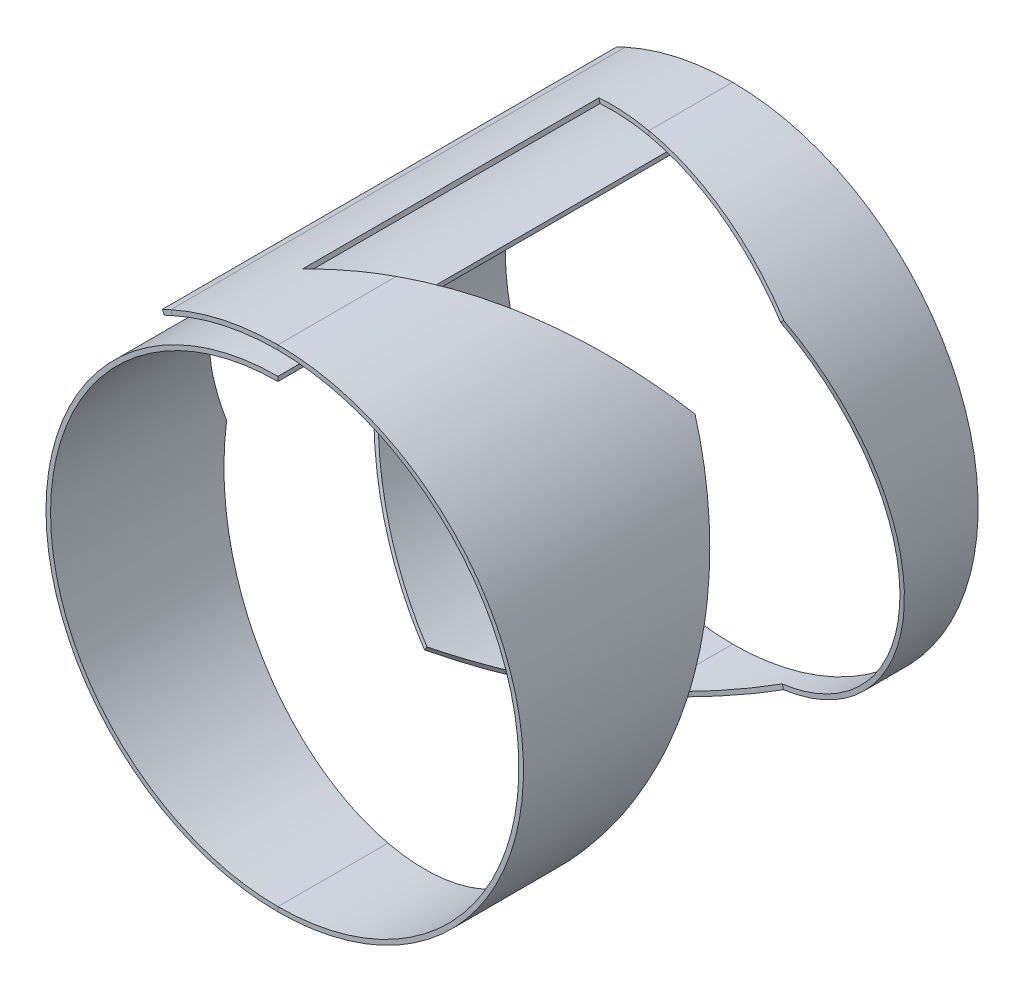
ISO-10303-21;
HEADER;
FILE_DESCRIPTION(('STEP AP214'),'2;1');
FILE_NAME('part.step','',(''),(''),'','','');
FILE_SCHEMA(('AUTOMOTIVE_DESIGN { 1 0 10303 214 1 1 1 1 }'));
ENDSEC;
DATA;
#1=APPLICATION_CONTEXT('core data for automotive mechanical design processes');
#2=APPLICATION_PROTOCOL_DEFINITION('international standard','automotive_design',2000,#1);
#3=PRODUCT_CONTEXT('',#1,'mechanical');
#4=PRODUCT('Part','Part','',(#3));
#5=PRODUCT_RELATED_PRODUCT_CATEGORY('part','',(#4));
#6=PRODUCT_DEFINITION_FORMATION('','',#4);
#7=PRODUCT_DEFINITION_CONTEXT('part definition',#1,'design');
#8=PRODUCT_DEFINITION('design','',#6,#7);
#9=PRODUCT_DEFINITION_SHAPE('','',#8);
#10=(LENGTH_UNIT() NAMED_UNIT(*) SI_UNIT(.MILLI.,.METRE.));
#11=(NAMED_UNIT(*) PLANE_ANGLE_UNIT() SI_UNIT($,.RADIAN.));
#12=(NAMED_UNIT(*) SI_UNIT($,.STERADIAN.) SOLID_ANGLE_UNIT());
#13=UNCERTAINTY_MEASURE_WITH_UNIT(LENGTH_MEASURE(1.E-05),#10,'distance_accuracy_value','');
#14=(GEOMETRIC_REPRESENTATION_CONTEXT(3) GLOBAL_UNCERTAINTY_ASSIGNED_CONTEXT((#13)) GLOBAL_UNIT_ASSIGNED_CONTEXT((#10,
#11,#12)) REPRESENTATION_CONTEXT('',''));
#15=CARTESIAN_POINT('',(0.,0.,0.));
#16=DIRECTION('',(0.,0.,1.));
#17=DIRECTION('',(1.,0.,0.));
#18=AXIS2_PLACEMENT_3D('',#15,#16,#17);
#19=CARTESIAN_POINT('',(57.3861057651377,-131.039212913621,100.));
#20=DIRECTION('',(0.910314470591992,0.413917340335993,0.));
#21=DIRECTION('',(-0.413917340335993,0.910314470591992,0.));
#22=AXIS2_PLACEMENT_3D('',#19,#20,#21);
#23=PLANE('',#22);
#24=DIRECTION('',(-0.413917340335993,0.910314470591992,0.));
#25=VECTOR('',#24,1.);
#26=CARTESIAN_POINT('',(57.3861057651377,-131.039212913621,100.));
#27=LINE('',#26,#25);
#28=CARTESIAN_POINT('',(-25.,50.1497756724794,100.));
#29=VERTEX_POINT('',#28);
#30=CARTESIAN_POINT('',(-25.413917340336,51.0600901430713,100.));
#31=VERTEX_POINT('',#30);
#32=EDGE_CURVE('E906',#29,#31,#27,.T.);
#33=ORIENTED_EDGE('',*,*,#32,.T.);
#34=DIRECTION('',(0.,0.,-1.));
#35=VECTOR('',#34,1.);
#36=CARTESIAN_POINT('',(-25.413917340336,51.0600901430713,100.));
#37=LINE('',#36,#35);
#38=CARTESIAN_POINT('',(-25.413917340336,51.0600901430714,0.));
#39=VERTEX_POINT('',#38);
#40=EDGE_CURVE('E917',#31,#39,#37,.T.);
#41=ORIENTED_EDGE('',*,*,#40,.T.);
#42=DIRECTION('',(-0.413917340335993,0.910314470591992,0.));
#43=VECTOR('',#42,1.);
#44=CARTESIAN_POINT('',(57.3861057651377,-131.039212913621,0.));
#45=LINE('',#44,#43);
#46=CARTESIAN_POINT('',(-25.,50.1497756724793,0.));
#47=VERTEX_POINT('',#46);
#48=EDGE_CURVE('E806',#47,#39,#45,.T.);
#49=ORIENTED_EDGE('',*,*,#48,.F.);
#50=DIRECTION('',(0.,0.,-1.));
#51=VECTOR('',#50,1.);
#52=CARTESIAN_POINT('',(-25.,50.1497756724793,100.));
#53=LINE('',#52,#51);
#54=EDGE_CURVE('E911',#29,#47,#53,.T.);
#55=ORIENTED_EDGE('',*,*,#54,.F.);
#56=EDGE_LOOP('',(#33,#41,#49,#55));
#57=FACE_BOUND('',#56,.T.);
#58=ADVANCED_FACE('F33',(#57),#23,.F.);
#59=CARTESIAN_POINT('',(-23.179371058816,50.9776103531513,100.));
#60=DIRECTION('',(-0.413917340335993,0.910314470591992,0.));
#61=DIRECTION('',(-0.910314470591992,-0.413917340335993,0.));
#62=AXIS2_PLACEMENT_3D('',#59,#60,#61);
#63=PLANE('',#62);
#64=DIRECTION('',(0.910314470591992,0.413917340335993,0.));
#65=VECTOR('',#64,1.);
#66=CARTESIAN_POINT('',(-23.179371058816,50.9776103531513,0.));
#67=LINE('',#66,#65);
#68=CARTESIAN_POINT('',(-23.179371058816,50.9776103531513,0.));
#69=VERTEX_POINT('',#68);
#70=EDGE_CURVE('E897',#47,#69,#67,.T.);
#71=ORIENTED_EDGE('',*,*,#70,.T.);
#72=DIRECTION('',(0.,0.,-1.));
#73=VECTOR('',#72,1.);
#74=CARTESIAN_POINT('',(-23.179371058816,50.9776103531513,100.));
#75=LINE('',#74,#73);
#76=CARTESIAN_POINT('',(-23.179371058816,50.9776103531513,100.));
#77=VERTEX_POINT('',#76);
#78=EDGE_CURVE('E889',#77,#69,#75,.T.);
#79=ORIENTED_EDGE('',*,*,#78,.F.);
#80=DIRECTION('',(0.910314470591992,0.413917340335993,0.));
#81=VECTOR('',#80,1.);
#82=CARTESIAN_POINT('',(-23.179371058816,50.9776103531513,100.));
#83=LINE('',#82,#81);
#84=EDGE_CURVE('E894',#29,#77,#83,.T.);
#85=ORIENTED_EDGE('',*,*,#84,.F.);
#86=ORIENTED_EDGE('',*,*,#54,.T.);
#87=EDGE_LOOP('',(#71,#79,#85,#86));
#88=FACE_BOUND('',#87,.T.);
#89=ADVANCED_FACE('F893',(#88),#63,.F.);
#90=CARTESIAN_POINT('',(59.2067347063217,-130.211378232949,100.));
#91=DIRECTION('',(0.,0.,1.));
#92=DIRECTION('',(1.,0.,0.));
#93=AXIS2_PLACEMENT_3D('',#90,#91,#92);
#94=PLANE('',#93);
#95=DIRECTION('',(-0.910314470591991,-0.413917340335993,0.));
#96=VECTOR('',#95,1.);
#97=CARTESIAN_POINT('',(-25.413917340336,51.0600901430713,100.));
#98=LINE('',#97,#96);
#99=CARTESIAN_POINT('',(-23.593288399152,51.8879248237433,100.));
#100=VERTEX_POINT('',#99);
#101=EDGE_CURVE('E907',#100,#31,#98,.T.);
#102=ORIENTED_EDGE('',*,*,#101,.T.);
#103=ORIENTED_EDGE('',*,*,#32,.F.);
#104=ORIENTED_EDGE('',*,*,#84,.T.);
#105=DIRECTION('',(-0.413917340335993,0.910314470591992,0.));
#106=VECTOR('',#105,1.);
#107=CARTESIAN_POINT('',(59.2067347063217,-130.211378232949,100.));
#108=LINE('',#107,#106);
#109=EDGE_CURVE('E887',#77,#100,#108,.T.);
#110=ORIENTED_EDGE('',*,*,#109,.T.);
#111=EDGE_LOOP('',(#102,#103,#104,#110));
#112=FACE_BOUND('',#111,.T.);
#113=ADVANCED_FACE('F904',(#112),#94,.T.);
#114=CARTESIAN_POINT('',(-25.413917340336,51.0600901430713,100.));
#115=DIRECTION('',(0.413917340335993,-0.910314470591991,0.));
#116=DIRECTION('',(0.910314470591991,0.413917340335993,0.));
#117=AXIS2_PLACEMENT_3D('',#114,#115,#116);
#118=PLANE('',#117);
#119=DIRECTION('',(-0.910314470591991,-0.413917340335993,0.));
#120=VECTOR('',#119,1.);
#121=CARTESIAN_POINT('',(-25.413917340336,51.0600901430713,0.));
#122=LINE('',#121,#120);
#123=CARTESIAN_POINT('',(-23.593288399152,51.8879248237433,0.));
#124=VERTEX_POINT('',#123);
#125=EDGE_CURVE('E909',#124,#39,#122,.T.);
#126=ORIENTED_EDGE('',*,*,#125,.T.);
#127=ORIENTED_EDGE('',*,*,#40,.F.);
#128=ORIENTED_EDGE('',*,*,#101,.F.);
#129=DIRECTION('',(0.,0.,-1.));
#130=VECTOR('',#129,1.);
#131=CARTESIAN_POINT('',(-23.593288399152,51.8879248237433,100.));
#132=LINE('',#131,#130);
#133=EDGE_CURVE('E1113',#100,#124,#132,.T.);
#134=ORIENTED_EDGE('',*,*,#133,.T.);
#135=EDGE_LOOP('',(#126,#127,#128,#134));
#136=FACE_BOUND('',#135,.T.);
#137=ADVANCED_FACE('F1103',(#136),#118,.F.);
#138=CARTESIAN_POINT('',(59.2067347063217,-130.211378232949,0.));
#139=DIRECTION('',(0.,0.,1.));
#140=DIRECTION('',(1.,0.,0.));
#141=AXIS2_PLACEMENT_3D('',#138,#139,#140);
#142=PLANE('',#141);
#143=ORIENTED_EDGE('',*,*,#48,.T.);
#144=ORIENTED_EDGE('',*,*,#125,.F.);
#145=DIRECTION('',(-0.413917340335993,0.910314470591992,0.));
#146=VECTOR('',#145,1.);
#147=CARTESIAN_POINT('',(59.2067347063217,-130.211378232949,0.));
#148=LINE('',#147,#146);
#149=EDGE_CURVE('E899',#69,#124,#148,.T.);
#150=ORIENTED_EDGE('',*,*,#149,.F.);
#151=ORIENTED_EDGE('',*,*,#70,.F.);
#152=EDGE_LOOP('',(#143,#144,#150,#151));
#153=FACE_BOUND('',#152,.T.);
#154=ADVANCED_FACE('F35',(#153),#142,.F.);
#155=CARTESIAN_POINT('',(-4.30211422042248E-13,-2.0122792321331E-13,0.));
#156=DIRECTION('',(0.,0.,-1.));
#157=DIRECTION('',(-1.,0.,0.));
#158=AXIS2_PLACEMENT_3D('',#155,#156,#157);
#159=PLANE('',#158);
#160=DIRECTION('',(0.,1.,0.));
#161=VECTOR('',#160,1.);
#162=CARTESIAN_POINT('',(-5.65519853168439E-13,55.9999999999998,0.));
#163=LINE('',#162,#161);
#164=CARTESIAN_POINT('',(-5.63562000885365E-13,55.9999999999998,0.));
#165=VERTEX_POINT('',#164);
#166=CARTESIAN_POINT('',(-5.65183262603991E-13,56.9999999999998,0.));
#167=VERTEX_POINT('',#166);
#168=EDGE_CURVE('E956',#165,#167,#163,.T.);
#169=ORIENTED_EDGE('',*,*,#168,.F.);
#170=CARTESIAN_POINT('',(-4.30211422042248E-13,-2.0122792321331E-13,0.));
#171=DIRECTION('',(0.,0.,1.));
#172=DIRECTION('',(1.,0.,0.));
#173=AXIS2_PLACEMENT_3D('',#170,#171,#172);
#174=CIRCLE('',#173,56.);
#175=EDGE_CURVE('E876',#165,#69,#174,.T.);
#176=ORIENTED_EDGE('',*,*,#175,.T.);
#177=ORIENTED_EDGE('',*,*,#149,.T.);
#178=CARTESIAN_POINT('',(-4.30211422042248E-13,-2.0122792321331E-13,0.));
#179=DIRECTION('',(0.,0.,1.));
#180=DIRECTION('',(1.,0.,0.));
#181=AXIS2_PLACEMENT_3D('',#178,#179,#180);
#182=CIRCLE('',#181,57.);
#183=EDGE_CURVE('E857',#167,#124,#182,.T.);
#184=ORIENTED_EDGE('',*,*,#183,.F.);
#185=EDGE_LOOP('',(#169,#176,#177,#184));
#186=FACE_BOUND('',#185,.T.);
#187=ADVANCED_FACE('F1100',(#186),#159,.T.);
#188=CARTESIAN_POINT('',(-4.30211422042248E-13,-2.0122792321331E-13,100.));
#189=DIRECTION('',(0.,0.,1.));
#190=DIRECTION('',(1.,0.,0.));
#191=AXIS2_PLACEMENT_3D('',#188,#189,#190);
#192=PLANE('',#191);
#193=ORIENTED_EDGE('',*,*,#109,.F.);
#194=CARTESIAN_POINT('',(-4.30211422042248E-13,-2.0122792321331E-13,100.));
#195=DIRECTION('',(0.,0.,1.));
#196=DIRECTION('',(1.,0.,0.));
#197=AXIS2_PLACEMENT_3D('',#194,#195,#196);
#198=CIRCLE('',#197,56.);
#199=CARTESIAN_POINT('',(-5.74570366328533E-13,55.9999999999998,100.));
#200=VERTEX_POINT('',#199);
#201=EDGE_CURVE('E685',#77,#200,#198,.F.);
#202=ORIENTED_EDGE('',*,*,#201,.T.);
#203=DIRECTION('',(0.,1.,0.));
#204=VECTOR('',#203,1.);
#205=CARTESIAN_POINT('',(-5.65519853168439E-13,55.9999999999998,100.));
#206=LINE('',#205,#204);
#207=CARTESIAN_POINT('',(-5.65519853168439E-13,56.9999999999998,100.));
#208=VERTEX_POINT('',#207);
#209=EDGE_CURVE('E885',#200,#208,#206,.T.);
#210=ORIENTED_EDGE('',*,*,#209,.T.);
#211=CARTESIAN_POINT('',(-4.30211422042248E-13,-2.0122792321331E-13,100.));
#212=DIRECTION('',(0.,0.,1.));
#213=DIRECTION('',(1.,0.,0.));
#214=AXIS2_PLACEMENT_3D('',#211,#212,#213);
#215=CIRCLE('',#214,57.);
#216=EDGE_CURVE('E874',#100,#208,#215,.F.);
#217=ORIENTED_EDGE('',*,*,#216,.F.);
#218=EDGE_LOOP('',(#193,#202,#210,#217));
#219=FACE_BOUND('',#218,.T.);
#220=ADVANCED_FACE('F748',(#219),#192,.T.);
#221=CARTESIAN_POINT('',(-13.3122613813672,55.423674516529,81.2617882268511));
#222=CARTESIAN_POINT('',(-8.95703932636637,56.4697591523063,78.8205000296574));
#223=CARTESIAN_POINT('',(-4.47909055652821,56.9999999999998,76.3797134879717));
#224=CARTESIAN_POINT('',(-5.65943261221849E-13,56.9999999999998,73.938425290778));
#225=CARTESIAN_POINT('',(-13.0787129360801,54.4513293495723,81.2617882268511));
#226=CARTESIAN_POINT('',(-8.79990054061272,55.4790610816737,78.8205013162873));
#227=CARTESIAN_POINT('',(-4.40050770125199,55.9999999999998,76.3797122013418));
#228=CARTESIAN_POINT('',(-5.63562000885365E-13,55.9999999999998,73.938425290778));
#229=B_SPLINE_SURFACE_WITH_KNOTS('',1,3,((#221,#222,#223,#224),(#225,#226,#227,#228)),
.UNSPECIFIED.,.F.,.F.,.F.,(2,2),(4,4),(0.,1.),(0.,1.),.UNSPECIFIED.);
#230=CARTESIAN_POINT('',(-5.65943261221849E-13,56.9999999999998,73.938425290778));
#231=CARTESIAN_POINT('',(-5.63562000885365E-13,55.9999999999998,73.938425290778));
#232=B_SPLINE_CURVE_WITH_KNOTS('',1,(#230,#231),.UNSPECIFIED.,.F.,.F.,(2,2),(0.,1.),.UNSPECIFIED.);
#233=CARTESIAN_POINT('',(-5.77173671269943E-13,56.9999999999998,73.938425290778));
#234=VERTEX_POINT('',#233);
#235=CARTESIAN_POINT('',(-5.62802002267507E-13,55.9999999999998,73.938425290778));
#236=VERTEX_POINT('',#235);
#237=EDGE_CURVE('E787',#234,#236,#232,.T.);
#238=CARTESIAN_POINT('',(-5.63562000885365E-13,55.9999999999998,73.938425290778));
#239=CARTESIAN_POINT('',(-4.40050770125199,55.9999999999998,76.3797122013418));
#240=CARTESIAN_POINT('',(-8.79990054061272,55.4790610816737,78.8205013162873));
#241=CARTESIAN_POINT('',(-13.0787129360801,54.4513293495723,81.2617882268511));
#242=B_SPLINE_CURVE_WITH_KNOTS('',3,(#238,#239,#240,#241),.UNSPECIFIED.,.F.,.F.,(4,4),(0.,1.),.UNSPECIFIED.);
#243=CARTESIAN_POINT('',(-13.0787129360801,54.4513293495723,81.2617882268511));
#244=VERTEX_POINT('',#243);
#245=EDGE_CURVE('E722',#244,#236,#242,.F.);
#246=CARTESIAN_POINT('',(-13.0787129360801,54.4513293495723,81.2617882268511));
#247=CARTESIAN_POINT('',(-13.3122613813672,55.423674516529,81.2617882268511));
#248=B_SPLINE_CURVE_WITH_KNOTS('',1,(#246,#247),.UNSPECIFIED.,.F.,.F.,(2,2),(0.,1.),.UNSPECIFIED.);
#249=CARTESIAN_POINT('',(-13.3122613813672,55.423674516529,81.2617882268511));
#250=VERTEX_POINT('',#249);
#251=EDGE_CURVE('E778',#244,#250,#248,.T.);
#252=CARTESIAN_POINT('',(-13.3122613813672,55.423674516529,81.2617882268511));
#253=CARTESIAN_POINT('',(-8.95703932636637,56.4697591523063,78.8205000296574));
#254=CARTESIAN_POINT('',(-4.47909055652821,56.9999999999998,76.3797134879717));
#255=CARTESIAN_POINT('',(-5.65943261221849E-13,56.9999999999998,73.938425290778));
#256=B_SPLINE_CURVE_WITH_KNOTS('',3,(#252,#253,#254,#255),.UNSPECIFIED.,.F.,.F.,(4,4),(0.,1.),.UNSPECIFIED.);
#257=EDGE_CURVE('E729',#250,#234,#256,.T.);
#258=ORIENTED_EDGE('',*,*,#237,.T.);
#259=ORIENTED_EDGE('',*,*,#245,.F.);
#260=ORIENTED_EDGE('',*,*,#251,.T.);
#261=ORIENTED_EDGE('',*,*,#257,.T.);
#262=EDGE_LOOP('',(#258,#259,#260,#261));
#263=FACE_BOUND('',#262,.T.);
#264=ADVANCED_FACE('F735',(#263),#229,.F.);
#265=CARTESIAN_POINT('',(-13.1954871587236,54.9375019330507,48.669711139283));
#266=DIRECTION('',(-0.972345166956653,-0.233548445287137,0.));
#267=DIRECTION('',(0.,0.,1.));
#268=AXIS2_PLACEMENT_3D('',#265,#266,#267);
#269=PLANE('',#268);
#270=ORIENTED_EDGE('',*,*,#251,.F.);
#271=DIRECTION('',(0.,0.,1.));
#272=VECTOR('',#271,1.);
#273=CARTESIAN_POINT('',(-13.0787129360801,54.4513293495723,-367.460026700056));
#274=LINE('',#273,#272);
#275=CARTESIAN_POINT('',(-13.0787129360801,54.4513293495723,16.0776340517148));
#276=VERTEX_POINT('',#275);
#277=EDGE_CURVE('E849',#276,#244,#274,.T.);
#278=ORIENTED_EDGE('',*,*,#277,.F.);
#279=CARTESIAN_POINT('',(-13.3122613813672,55.423674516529,16.0776340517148));
#280=CARTESIAN_POINT('',(-13.0787129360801,54.4513293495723,16.0776340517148));
#281=B_SPLINE_CURVE_WITH_KNOTS('',1,(#279,#280),.UNSPECIFIED.,.F.,.F.,(2,2),(0.,1.),.UNSPECIFIED.);
#282=CARTESIAN_POINT('',(-13.3122613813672,55.423674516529,16.0776340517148));
#283=VERTEX_POINT('',#282);
#284=EDGE_CURVE('E839',#276,#283,#281,.F.);
#285=ORIENTED_EDGE('',*,*,#284,.T.);
#286=DIRECTION('',(0.,0.,1.));
#287=VECTOR('',#286,1.);
#288=CARTESIAN_POINT('',(-13.3122613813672,55.423674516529,-367.460026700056));
#289=LINE('',#288,#287);
#290=EDGE_CURVE('E848',#283,#250,#289,.T.);
#291=ORIENTED_EDGE('',*,*,#290,.T.);
#292=EDGE_LOOP('',(#270,#278,#285,#291));
#293=FACE_BOUND('',#292,.T.);
#294=ADVANCED_FACE('F747',(#293),#269,.F.);
#295=CARTESIAN_POINT('',(-5.65943261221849E-13,56.9999999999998,18.4083695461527));
#296=CARTESIAN_POINT('',(-4.47916411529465,56.9999999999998,17.6313917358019));
#297=CARTESIAN_POINT('',(-8.95696780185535,56.4697763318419,16.8546118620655));
#298=CARTESIAN_POINT('',(-13.3122613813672,55.423674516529,16.0776340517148));
#299=CARTESIAN_POINT('',(-5.63562000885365E-13,55.9999999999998,18.4083695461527));
#300=CARTESIAN_POINT('',(-4.40058192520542,55.9999999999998,17.6313917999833));
#301=CARTESIAN_POINT('',(-8.79982836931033,55.4790784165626,16.8546117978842));
#302=CARTESIAN_POINT('',(-13.0787129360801,54.4513293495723,16.0776340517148));
#303=B_SPLINE_SURFACE_WITH_KNOTS('',1,3,((#295,#296,#297,#298),(#299,#300,#301,#302)),
.UNSPECIFIED.,.F.,.F.,.F.,(2,2),(4,4),(0.,1.),(0.,1.),.UNSPECIFIED.);
#304=CARTESIAN_POINT('',(-13.0787129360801,54.4513293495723,16.0776340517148));
#305=CARTESIAN_POINT('',(-8.79982836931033,55.4790784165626,16.8546117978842));
#306=CARTESIAN_POINT('',(-4.40058192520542,55.9999999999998,17.6313917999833));
#307=CARTESIAN_POINT('',(-5.63562000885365E-13,55.9999999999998,18.4083695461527));
#308=B_SPLINE_CURVE_WITH_KNOTS('',3,(#304,#305,#306,#307),.UNSPECIFIED.,.F.,.F.,(4,4),(0.,1.),.UNSPECIFIED.);
#309=CARTESIAN_POINT('',(-5.63562000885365E-13,55.9999999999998,18.4083695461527));
#310=VERTEX_POINT('',#309);
#311=EDGE_CURVE('E855',#310,#276,#308,.F.);
#312=CARTESIAN_POINT('',(-5.63562000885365E-13,55.9999999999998,18.4083695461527));
#313=CARTESIAN_POINT('',(-5.65943261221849E-13,56.9999999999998,18.4083695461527));
#314=B_SPLINE_CURVE_WITH_KNOTS('',1,(#312,#313),.UNSPECIFIED.,.F.,.F.,(2,2),(0.,1.),.UNSPECIFIED.);
#315=CARTESIAN_POINT('',(-5.65943261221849E-13,56.9999999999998,18.4083695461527));
#316=VERTEX_POINT('',#315);
#317=EDGE_CURVE('E801',#310,#316,#314,.T.);
#318=CARTESIAN_POINT('',(-5.65943261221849E-13,56.9999999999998,18.4083695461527));
#319=CARTESIAN_POINT('',(-4.47916411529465,56.9999999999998,17.6313917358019));
#320=CARTESIAN_POINT('',(-8.95696780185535,56.4697763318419,16.8546118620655));
#321=CARTESIAN_POINT('',(-13.3122613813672,55.423674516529,16.0776340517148));
#322=B_SPLINE_CURVE_WITH_KNOTS('',3,(#318,#319,#320,#321),.UNSPECIFIED.,.F.,.F.,(4,4),(0.,1.),.UNSPECIFIED.);
#323=EDGE_CURVE('E851',#316,#283,#322,.T.);
#324=ORIENTED_EDGE('',*,*,#284,.F.);
#325=ORIENTED_EDGE('',*,*,#311,.F.);
#326=ORIENTED_EDGE('',*,*,#317,.T.);
#327=ORIENTED_EDGE('',*,*,#323,.T.);
#328=EDGE_LOOP('',(#324,#325,#326,#327));
#329=FACE_BOUND('',#328,.T.);
#330=ADVANCED_FACE('F808',(#329),#303,.F.);
#331=CARTESIAN_POINT('',(-4.30211422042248E-13,-2.0122792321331E-13,-367.460026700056));
#332=DIRECTION('',(0.,0.,1.));
#333=DIRECTION('',(1.,0.,0.));
#334=AXIS2_PLACEMENT_3D('',#331,#332,#333);
#335=CYLINDRICAL_SURFACE('',#334,57.);
#336=ORIENTED_EDGE('',*,*,#323,.F.);
#337=DIRECTION('',(0.,0.,-1.));
#338=VECTOR('',#337,1.);
#339=CARTESIAN_POINT('',(-5.65519853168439E-13,56.9999999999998,100.));
#340=LINE('',#339,#338);
#341=EDGE_CURVE('E932',#316,#167,#340,.T.);
#342=ORIENTED_EDGE('',*,*,#341,.T.);
#343=ORIENTED_EDGE('',*,*,#183,.T.);
#344=ORIENTED_EDGE('',*,*,#133,.F.);
#345=ORIENTED_EDGE('',*,*,#216,.T.);
#346=EDGE_CURVE('E928',#208,#234,#340,.T.);
#347=ORIENTED_EDGE('',*,*,#346,.T.);
#348=ORIENTED_EDGE('',*,*,#257,.F.);
#349=ORIENTED_EDGE('',*,*,#290,.F.);
#350=EDGE_LOOP('',(#336,#342,#343,#344,#345,#347,#348,#349));
#351=FACE_BOUND('',#350,.T.);
#352=ADVANCED_FACE('F696',(#351),#335,.T.);
#353=CARTESIAN_POINT('',(-4.30211422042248E-13,-2.0122792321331E-13,-367.460026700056));
#354=DIRECTION('',(0.,0.,1.));
#355=DIRECTION('',(1.,0.,0.));
#356=AXIS2_PLACEMENT_3D('',#353,#354,#355);
#357=CYLINDRICAL_SURFACE('',#356,56.);
#358=ORIENTED_EDGE('',*,*,#311,.T.);
#359=ORIENTED_EDGE('',*,*,#277,.T.);
#360=ORIENTED_EDGE('',*,*,#245,.T.);
#361=DIRECTION('',(0.,0.,-1.));
#362=VECTOR('',#361,1.);
#363=CARTESIAN_POINT('',(-5.65519853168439E-13,55.9999999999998,100.));
#364=LINE('',#363,#362);
#365=EDGE_CURVE('E890',#200,#236,#364,.T.);
#366=ORIENTED_EDGE('',*,*,#365,.F.);
#367=ORIENTED_EDGE('',*,*,#201,.F.);
#368=ORIENTED_EDGE('',*,*,#78,.T.);
#369=ORIENTED_EDGE('',*,*,#175,.F.);
#370=EDGE_CURVE('E934',#310,#165,#364,.T.);
#371=ORIENTED_EDGE('',*,*,#370,.F.);
#372=EDGE_LOOP('',(#358,#359,#360,#366,#367,#368,#369,#371));
#373=FACE_BOUND('',#372,.T.);
#374=ADVANCED_FACE('F613',(#373),#357,.F.);
#375=CARTESIAN_POINT('',(40.6198799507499,38.5812500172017,48.8914259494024));
#376=CARTESIAN_POINT('',(38.0952861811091,41.4633493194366,50.9787011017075));
#377=CARTESIAN_POINT('',(35.262954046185,44.0755862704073,53.0659258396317));
#378=CARTESIAN_POINT('',(29.1100919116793,48.6429870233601,57.240425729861));
#379=CARTESIAN_POINT('',(25.7898024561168,50.5979600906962,59.3276756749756));
#380=CARTESIAN_POINT('',(18.8109262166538,53.7624740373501,63.5021755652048));
#381=CARTESIAN_POINT('',(15.1525776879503,54.9719068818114,65.5894255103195));
#382=CARTESIAN_POINT('',(7.66269257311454,56.5906974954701,69.7639254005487));
#383=CARTESIAN_POINT('',(3.83145795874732,56.9999999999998,71.8511501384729));
#384=CARTESIAN_POINT('',(-5.77173671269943E-13,56.9999999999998,73.938425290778));
#385=CARTESIAN_POINT('',(39.867659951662,37.9223379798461,48.8914259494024));
#386=CARTESIAN_POINT('',(37.3898181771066,40.751064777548,50.97870088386));
#387=CARTESIAN_POINT('',(34.6099363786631,43.3149272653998,53.0659258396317));
#388=CARTESIAN_POINT('',(28.5710161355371,47.7977465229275,57.240425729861));
#389=CARTESIAN_POINT('',(25.3122135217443,49.7165163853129,59.3276756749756));
#390=CARTESIAN_POINT('',(18.4625757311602,52.8224282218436,63.5021755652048));
#391=CARTESIAN_POINT('',(14.8719743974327,54.0094641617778,65.5894255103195));
#392=CARTESIAN_POINT('',(7.5207908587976,55.5982771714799,69.7639254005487));
#393=CARTESIAN_POINT('',(3.7605046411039,55.9999999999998,71.8511503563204));
#394=CARTESIAN_POINT('',(-5.74570366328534E-13,55.9999999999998,73.938425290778));
#395=B_SPLINE_SURFACE_WITH_KNOTS('',1,3,((#375,#376,#377,#378,#379,#380,#381,#382,#383,#384),
(#385,#386,#387,#388,#389,#390,#391,#392,#393,#394)),.UNSPECIFIED.,.F.,.F.,.F.,(2,2),(4,2,2,2,
4),(0.,1.),(0.,0.25,0.5,0.75,1.),.UNSPECIFIED.);
#396=CARTESIAN_POINT('',(39.8676599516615,37.9223379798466,48.8914259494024));
#397=CARTESIAN_POINT('',(40.6198799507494,38.5812500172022,48.8914259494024));
#398=B_SPLINE_CURVE_WITH_KNOTS('',1,(#396,#397),.UNSPECIFIED.,.F.,.F.,(2,2),(0.,1.),.UNSPECIFIED.);
#399=CARTESIAN_POINT('',(39.867659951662,37.9223379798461,48.8914259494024));
#400=VERTEX_POINT('',#399);
#401=CARTESIAN_POINT('',(40.6198795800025,38.5812504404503,48.8914262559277));
#402=VERTEX_POINT('',#401);
#403=EDGE_CURVE('E644',#400,#402,#398,.T.);
#404=CARTESIAN_POINT('',(39.867659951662,37.9223379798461,48.8914259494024));
#405=CARTESIAN_POINT('',(37.3898181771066,40.751064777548,50.97870088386));
#406=CARTESIAN_POINT('',(34.6099363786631,43.3149272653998,53.0659258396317));
#407=CARTESIAN_POINT('',(28.5710161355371,47.7977465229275,57.240425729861));
#408=CARTESIAN_POINT('',(25.3122135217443,49.7165163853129,59.3276756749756));
#409=CARTESIAN_POINT('',(18.4625757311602,52.8224282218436,63.5021755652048));
#410=CARTESIAN_POINT('',(14.8719743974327,54.0094641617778,65.5894255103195));
#411=CARTESIAN_POINT('',(7.5207908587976,55.5982771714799,69.7639254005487));
#412=CARTESIAN_POINT('',(3.7605046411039,55.9999999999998,71.8511503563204));
#413=CARTESIAN_POINT('',(-5.74570366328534E-13,55.9999999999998,73.938425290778));
#414=B_SPLINE_CURVE_WITH_KNOTS('',3,(#404,#405,#406,#407,#408,#409,#410,#411,#412,#413),
.UNSPECIFIED.,.F.,.F.,(4,2,2,2,4),(0.,0.25,0.5,0.75,1.),.UNSPECIFIED.);
#415=EDGE_CURVE('E533',#400,#236,#414,.T.);
#416=CARTESIAN_POINT('',(-5.77173671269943E-13,56.9999999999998,73.938425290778));
#417=CARTESIAN_POINT('',(3.83145795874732,56.9999999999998,71.8511501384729));
#418=CARTESIAN_POINT('',(7.66269257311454,56.5906974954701,69.7639254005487));
#419=CARTESIAN_POINT('',(15.1525776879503,54.9719068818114,65.5894255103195));
#420=CARTESIAN_POINT('',(18.8109262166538,53.7624740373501,63.5021755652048));
#421=CARTESIAN_POINT('',(25.7898024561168,50.5979600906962,59.3276756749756));
#422=CARTESIAN_POINT('',(29.1100919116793,48.6429870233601,57.240425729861));
#423=CARTESIAN_POINT('',(35.262954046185,44.0755862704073,53.0659258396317));
#424=CARTESIAN_POINT('',(38.0952861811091,41.4633493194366,50.9787011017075));
#425=CARTESIAN_POINT('',(40.6198799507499,38.5812500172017,48.8914259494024));
#426=B_SPLINE_CURVE_WITH_KNOTS('',3,(#416,#417,#418,#419,#420,#421,#422,#423,#424,#425),
.UNSPECIFIED.,.F.,.F.,(4,2,2,2,4),(0.,0.25,0.5,0.75,1.),.UNSPECIFIED.);
#427=EDGE_CURVE('E578',#402,#234,#426,.F.);
#428=ORIENTED_EDGE('',*,*,#403,.F.);
#429=ORIENTED_EDGE('',*,*,#415,.T.);
#430=ORIENTED_EDGE('',*,*,#237,.F.);
#431=ORIENTED_EDGE('',*,*,#427,.F.);
#432=EDGE_LOOP('',(#428,#429,#430,#431));
#433=FACE_BOUND('',#432,.T.);
#434=ADVANCED_FACE('F601',(#433),#395,.T.);
#435=CARTESIAN_POINT('',(-4.36595204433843E-13,2.99999999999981,100.));
#436=DIRECTION('',(0.,0.,-1.));
#437=DIRECTION('',(-1.,0.,0.));
#438=AXIS2_PLACEMENT_3D('',#435,#436,#437);
#439=PLANE('',#438);
#440=ORIENTED_EDGE('',*,*,#209,.F.);
#441=CARTESIAN_POINT('',(-4.36595204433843E-13,2.99999999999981,100.));
#442=DIRECTION('',(0.,0.,1.));
#443=DIRECTION('',(1.,0.,0.));
#444=AXIS2_PLACEMENT_3D('',#441,#442,#443);
#445=CIRCLE('',#444,53.);
#446=CARTESIAN_POINT('',(-1.13797860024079E-12,-50.0000000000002,100.));
#447=VERTEX_POINT('',#446);
#448=EDGE_CURVE('E525',#447,#200,#445,.T.);
#449=ORIENTED_EDGE('',*,*,#448,.F.);
#450=DIRECTION('',(0.,-1.,0.));
#451=VECTOR('',#450,1.);
#452=CARTESIAN_POINT('',(-1.13797860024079E-12,-50.0000000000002,100.));
#453=LINE('',#452,#451);
#454=CARTESIAN_POINT('',(-1.14614239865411E-12,-51.0000000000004,100.));
#455=VERTEX_POINT('',#454);
#456=EDGE_CURVE('E938',#447,#455,#453,.T.);
#457=ORIENTED_EDGE('',*,*,#456,.T.);
#458=CARTESIAN_POINT('',(-4.36595204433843E-13,2.99999999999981,100.));
#459=DIRECTION('',(0.,0.,1.));
#460=DIRECTION('',(1.,0.,0.));
#461=AXIS2_PLACEMENT_3D('',#458,#459,#460);
#462=CIRCLE('',#461,54.);
#463=EDGE_CURVE('E539',#455,#208,#462,.T.);
#464=ORIENTED_EDGE('',*,*,#463,.T.);
#465=EDGE_LOOP('',(#440,#449,#457,#464));
#466=FACE_BOUND('',#465,.T.);
#467=ADVANCED_FACE('F612',(#466),#439,.F.);
#468=CARTESIAN_POINT('',(-1.26186230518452E-12,-51.0000000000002,75.7913313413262));
#469=CARTESIAN_POINT('',(2.46426828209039,-51.0000000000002,76.2472039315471));
#470=CARTESIAN_POINT('',(4.92850935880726,-50.831054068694,76.7030741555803));
#471=CARTESIAN_POINT('',(9.81091867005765,-50.1584279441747,77.6148169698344));
#472=CARTESIAN_POINT('',(12.2290519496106,-49.6547516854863,78.0706883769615));
#473=CARTESIAN_POINT('',(16.9739808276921,-48.3220864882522,78.9824311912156));
#474=CARTESIAN_POINT('',(19.3007486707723,-47.4931053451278,79.4383025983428));
#475=CARTESIAN_POINT('',(23.8194038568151,-45.5253396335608,80.3500454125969));
#476=CARTESIAN_POINT('',(26.0112593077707,-44.3865699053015,80.8059156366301));
#477=CARTESIAN_POINT('',(28.1151760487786,-43.1035451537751,81.261788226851));
#478=CARTESIAN_POINT('',(-1.24657958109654E-12,-50.0000000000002,75.7913313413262));
#479=CARTESIAN_POINT('',(2.41863367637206,-50.0000000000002,76.2472039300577));
#480=CARTESIAN_POINT('',(4.83724066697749,-49.8341826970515,76.7030741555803));
#481=CARTESIAN_POINT('',(9.62923499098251,-49.1740126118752,77.6148169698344));
#482=CARTESIAN_POINT('',(12.0025880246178,-48.6796636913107,78.0706883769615));
#483=CARTESIAN_POINT('',(16.6596478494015,-47.3716774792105,78.9824311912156));
#484=CARTESIAN_POINT('',(18.9433273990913,-46.5580478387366,79.4383025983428));
#485=CARTESIAN_POINT('',(23.3783037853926,-44.6267222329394,80.3500454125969));
#486=CARTESIAN_POINT('',(25.5295693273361,-43.5090408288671,80.8059156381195));
#487=CARTESIAN_POINT('',(27.5945246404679,-42.2497757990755,81.261788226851));
#488=B_SPLINE_SURFACE_WITH_KNOTS('',1,3,((#468,#469,#470,#471,#472,#473,#474,#475,#476,#477),
(#478,#479,#480,#481,#482,#483,#484,#485,#486,#487)),.UNSPECIFIED.,.F.,.F.,.F.,(2,2),(4,2,2,2,
4),(0.,1.),(0.,0.25,0.5,0.75,1.),.UNSPECIFIED.);
#489=CARTESIAN_POINT('',(-1.26186230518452E-12,-51.0000000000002,75.7913313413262));
#490=CARTESIAN_POINT('',(-1.24657958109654E-12,-50.0000000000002,75.7913313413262));
#491=B_SPLINE_CURVE_WITH_KNOTS('',1,(#489,#490),.UNSPECIFIED.,.F.,.F.,(2,2),(0.,1.),.UNSPECIFIED.);
#492=CARTESIAN_POINT('',(-1.16573417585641E-12,-51.0000000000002,75.7913313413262));
#493=VERTEX_POINT('',#492);
#494=CARTESIAN_POINT('',(-1.13797860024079E-12,-50.0000000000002,75.7913313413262));
#495=VERTEX_POINT('',#494);
#496=EDGE_CURVE('E365',#493,#495,#491,.T.);
#497=CARTESIAN_POINT('',(-1.24657958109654E-12,-50.0000000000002,75.7913313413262));
#498=CARTESIAN_POINT('',(2.41863367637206,-50.0000000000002,76.2472039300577));
#499=CARTESIAN_POINT('',(4.83724066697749,-49.8341826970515,76.7030741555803));
#500=CARTESIAN_POINT('',(9.62923499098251,-49.1740126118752,77.6148169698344));
#501=CARTESIAN_POINT('',(12.0025880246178,-48.6796636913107,78.0706883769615));
#502=CARTESIAN_POINT('',(16.6596478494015,-47.3716774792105,78.9824311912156));
#503=CARTESIAN_POINT('',(18.9433273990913,-46.5580478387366,79.4383025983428));
#504=CARTESIAN_POINT('',(23.3783037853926,-44.6267222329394,80.3500454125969));
#505=CARTESIAN_POINT('',(25.5295693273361,-43.5090408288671,80.8059156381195));
#506=CARTESIAN_POINT('',(27.5945246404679,-42.2497757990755,81.261788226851));
#507=B_SPLINE_CURVE_WITH_KNOTS('',3,(#497,#498,#499,#500,#501,#502,#503,#504,#505,#506),
.UNSPECIFIED.,.F.,.F.,(4,2,2,2,4),(0.,0.25,0.5,0.75,1.),.UNSPECIFIED.);
#508=CARTESIAN_POINT('',(27.5945246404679,-42.2497757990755,81.261788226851));
#509=VERTEX_POINT('',#508);
#510=EDGE_CURVE('E534',#495,#509,#507,.T.);
#511=CARTESIAN_POINT('',(27.5945246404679,-42.2497757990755,81.261788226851));
#512=CARTESIAN_POINT('',(28.1151760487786,-43.1035451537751,81.261788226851));
#513=B_SPLINE_CURVE_WITH_KNOTS('',1,(#511,#512),.UNSPECIFIED.,.F.,.F.,(2,2),(0.,1.),.UNSPECIFIED.);
#514=CARTESIAN_POINT('',(28.1151752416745,-43.1035456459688,81.2617880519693));
#515=VERTEX_POINT('',#514);
#516=EDGE_CURVE('E664',#509,#515,#513,.T.);
#517=CARTESIAN_POINT('',(28.1151760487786,-43.1035451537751,81.261788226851));
#518=CARTESIAN_POINT('',(26.0112593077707,-44.3865699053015,80.8059156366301));
#519=CARTESIAN_POINT('',(23.8194038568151,-45.5253396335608,80.3500454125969));
#520=CARTESIAN_POINT('',(19.3007486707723,-47.4931053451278,79.4383025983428));
#521=CARTESIAN_POINT('',(16.9739808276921,-48.3220864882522,78.9824311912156));
#522=CARTESIAN_POINT('',(12.2290519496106,-49.6547516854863,78.0706883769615));
#523=CARTESIAN_POINT('',(9.81091867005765,-50.1584279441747,77.6148169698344));
#524=CARTESIAN_POINT('',(4.92850935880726,-50.831054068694,76.7030741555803));
#525=CARTESIAN_POINT('',(2.46426828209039,-51.0000000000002,76.2472039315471));
#526=CARTESIAN_POINT('',(-1.26186230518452E-12,-51.0000000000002,75.7913313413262));
#527=B_SPLINE_CURVE_WITH_KNOTS('',3,(#517,#518,#519,#520,#521,#522,#523,#524,#525,#526),
.UNSPECIFIED.,.F.,.F.,(4,2,2,2,4),(0.,0.25,0.5,0.75,1.),.UNSPECIFIED.);
#528=EDGE_CURVE('E965',#493,#515,#527,.F.);
#529=ORIENTED_EDGE('',*,*,#496,.T.);
#530=ORIENTED_EDGE('',*,*,#510,.T.);
#531=ORIENTED_EDGE('',*,*,#516,.T.);
#532=ORIENTED_EDGE('',*,*,#528,.F.);
#533=EDGE_LOOP('',(#529,#530,#531,#532));
#534=FACE_BOUND('',#533,.T.);
#535=ADVANCED_FACE('F551',(#534),#488,.T.);
#536=CARTESIAN_POINT('',(28.1151760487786,-43.1035451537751,81.2617882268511));
#537=CARTESIAN_POINT('',(31.4626408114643,-41.0621715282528,79.9130024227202));
#538=CARTESIAN_POINT('',(34.586680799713,-38.6549368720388,78.5642580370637));
#539=CARTESIAN_POINT('',(40.2410437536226,-33.2219636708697,75.8667278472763));
#540=CARTESIAN_POINT('',(42.7711036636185,-30.1964598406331,74.5179627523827));
#541=CARTESIAN_POINT('',(47.1177893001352,-23.6699491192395,71.8204325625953));
#542=CARTESIAN_POINT('',(48.9342523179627,-20.169186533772,70.4716674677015));
#543=CARTESIAN_POINT('',(51.7678452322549,-12.8575677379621,67.7741372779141));
#544=CARTESIAN_POINT('',(52.7848690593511,-9.04698522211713,66.4253721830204));
#545=CARTESIAN_POINT('',(53.9714594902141,-1.29579038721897,63.727841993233));
#546=CARTESIAN_POINT('',(54.140981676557,2.64453178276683,62.3790768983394));
#547=CARTESIAN_POINT('',(53.624493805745,10.4689971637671,59.681546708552));
#548=CARTESIAN_POINT('',(52.9385030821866,14.3528474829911,58.3327816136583));
#549=CARTESIAN_POINT('',(50.7433450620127,21.8808153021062,55.6352514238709));
#550=CARTESIAN_POINT('',(49.2342599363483,25.5246510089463,54.2864863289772));
#551=CARTESIAN_POINT('',(45.4641704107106,32.400365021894,51.5889561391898));
#552=CARTESIAN_POINT('',(43.203346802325,35.6319406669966,50.2402117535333));
#553=CARTESIAN_POINT('',(40.6198799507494,38.5812500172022,48.8914259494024));
#554=CARTESIAN_POINT('',(27.5945246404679,-42.2497757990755,81.2617882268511));
#555=CARTESIAN_POINT('',(30.879999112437,-40.246205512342,79.9130025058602));
#556=CARTESIAN_POINT('',(33.9461867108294,-37.8835491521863,78.5642580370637));
#557=CARTESIAN_POINT('',(39.4958392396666,-32.5511865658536,75.8667278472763));
#558=CARTESIAN_POINT('',(41.9790461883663,-29.5817105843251,74.5179627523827));
#559=CARTESIAN_POINT('',(46.245237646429,-23.1760611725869,71.8204325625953));
#560=CARTESIAN_POINT('',(48.0280624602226,-19.7401275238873,70.4716674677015));
#561=CARTESIAN_POINT('',(50.8091814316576,-12.563909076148,67.7741372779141));
#562=CARTESIAN_POINT('',(51.8073714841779,-8.82389290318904,66.4253721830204));
#563=CARTESIAN_POINT('',(52.9719880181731,-1.21623871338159,63.727841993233));
#564=CARTESIAN_POINT('',(53.1383709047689,2.65111452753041,62.3790768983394));
#565=CARTESIAN_POINT('',(52.6314476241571,10.3306824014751,59.681546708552));
#566=CARTESIAN_POINT('',(51.9581604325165,14.1426095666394,58.3327816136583));
#567=CARTESIAN_POINT('',(49.8036534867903,21.5311705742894,55.6352514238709));
#568=CARTESIAN_POINT('',(48.3225143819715,25.107527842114,54.2864863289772));
#569=CARTESIAN_POINT('',(44.6222413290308,31.8559138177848,51.5889561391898));
#570=CARTESIAN_POINT('',(42.4032846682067,35.0276456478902,50.2402116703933));
#571=CARTESIAN_POINT('',(39.8676599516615,37.9223379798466,48.8914259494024));
#572=B_SPLINE_SURFACE_WITH_KNOTS('',1,3,((#536,#537,#538,#539,#540,#541,#542,#543,#544,#545,
#546,#547,#548,#549,#550,#551,#552,#553),(#554,#555,#556,#557,#558,#559,#560,#561,#562,#563,
#564,#565,#566,#567,#568,#569,#570,#571)),.UNSPECIFIED.,.F.,.F.,.F.,(2,2),(4,2,2,2,2,2,2,2,4),
(0.,1.),(0.,0.125,0.25,0.375,0.5,0.625,0.75,0.875,1.),.UNSPECIFIED.);
#573=CARTESIAN_POINT('',(27.5945246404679,-42.2497757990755,81.2617882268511));
#574=CARTESIAN_POINT('',(30.879999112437,-40.246205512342,79.9130025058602));
#575=CARTESIAN_POINT('',(33.9461867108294,-37.8835491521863,78.5642580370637));
#576=CARTESIAN_POINT('',(39.4958392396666,-32.5511865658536,75.8667278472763));
#577=CARTESIAN_POINT('',(41.9790461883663,-29.5817105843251,74.5179627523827));
#578=CARTESIAN_POINT('',(46.245237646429,-23.1760611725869,71.8204325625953));
#579=CARTESIAN_POINT('',(48.0280624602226,-19.7401275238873,70.4716674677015));
#580=CARTESIAN_POINT('',(50.8091814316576,-12.563909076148,67.7741372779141));
#581=CARTESIAN_POINT('',(51.8073714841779,-8.82389290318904,66.4253721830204));
#582=CARTESIAN_POINT('',(52.9719880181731,-1.21623871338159,63.727841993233));
#583=CARTESIAN_POINT('',(53.1383709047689,2.65111452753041,62.3790768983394));
#584=CARTESIAN_POINT('',(52.6314476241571,10.3306824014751,59.681546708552));
#585=CARTESIAN_POINT('',(51.9581604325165,14.1426095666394,58.3327816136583));
#586=CARTESIAN_POINT('',(49.8036534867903,21.5311705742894,55.6352514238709));
#587=CARTESIAN_POINT('',(48.3225143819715,25.107527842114,54.2864863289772));
#588=CARTESIAN_POINT('',(44.6222413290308,31.8559138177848,51.5889561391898));
#589=CARTESIAN_POINT('',(42.4032846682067,35.0276456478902,50.2402116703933));
#590=CARTESIAN_POINT('',(39.8676599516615,37.9223379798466,48.8914259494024));
#591=B_SPLINE_CURVE_WITH_KNOTS('',3,(#573,#574,#575,#576,#577,#578,#579,#580,#581,#582,#583,
#584,#585,#586,#587,#588,#589,#590),.UNSPECIFIED.,.F.,.F.,(4,2,2,2,2,2,2,2,4),(0.,0.125,0.25,
0.375,0.5,0.625,0.75,0.875,1.),.UNSPECIFIED.);
#592=EDGE_CURVE('E967',#509,#400,#591,.T.);
#593=CARTESIAN_POINT('',(40.6198799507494,38.5812500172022,48.8914259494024));
#594=CARTESIAN_POINT('',(43.203346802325,35.6319406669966,50.2402117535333));
#595=CARTESIAN_POINT('',(45.4641704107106,32.400365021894,51.5889561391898));
#596=CARTESIAN_POINT('',(49.2342599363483,25.5246510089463,54.2864863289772));
#597=CARTESIAN_POINT('',(50.7433450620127,21.8808153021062,55.6352514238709));
#598=CARTESIAN_POINT('',(52.9385030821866,14.3528474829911,58.3327816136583));
#599=CARTESIAN_POINT('',(53.624493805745,10.4689971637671,59.681546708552));
#600=CARTESIAN_POINT('',(54.140981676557,2.64453178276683,62.3790768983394));
#601=CARTESIAN_POINT('',(53.9714594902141,-1.29579038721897,63.727841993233));
#602=CARTESIAN_POINT('',(52.7848690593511,-9.04698522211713,66.4253721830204));
#603=CARTESIAN_POINT('',(51.7678452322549,-12.8575677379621,67.7741372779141));
#604=CARTESIAN_POINT('',(48.9342523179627,-20.169186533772,70.4716674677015));
#605=CARTESIAN_POINT('',(47.1177893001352,-23.6699491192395,71.8204325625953));
#606=CARTESIAN_POINT('',(42.7711036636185,-30.1964598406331,74.5179627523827));
#607=CARTESIAN_POINT('',(40.2410437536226,-33.2219636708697,75.8667278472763));
#608=CARTESIAN_POINT('',(34.586680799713,-38.6549368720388,78.5642580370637));
#609=CARTESIAN_POINT('',(31.4626408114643,-41.0621715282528,79.9130024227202));
#610=CARTESIAN_POINT('',(28.1151760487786,-43.1035451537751,81.2617882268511));
#611=B_SPLINE_CURVE_WITH_KNOTS('',3,(#593,#594,#595,#596,#597,#598,#599,#600,#601,#602,#603,
#604,#605,#606,#607,#608,#609,#610),.UNSPECIFIED.,.F.,.F.,(4,2,2,2,2,2,2,2,4),(0.,0.125,0.25,
0.375,0.5,0.625,0.75,0.875,1.),.UNSPECIFIED.);
#612=EDGE_CURVE('E966',#515,#402,#611,.F.);
#613=ORIENTED_EDGE('',*,*,#592,.T.);
#614=ORIENTED_EDGE('',*,*,#403,.T.);
#615=ORIENTED_EDGE('',*,*,#612,.F.);
#616=ORIENTED_EDGE('',*,*,#516,.F.);
#617=EDGE_LOOP('',(#613,#614,#615,#616));
#618=FACE_BOUND('',#617,.T.);
#619=ADVANCED_FACE('F550',(#618),#572,.T.);
#620=CARTESIAN_POINT('',(-4.36595204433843E-13,2.99999999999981,-366.12734831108));
#621=DIRECTION('',(0.,0.,1.));
#622=DIRECTION('',(1.,0.,0.));
#623=AXIS2_PLACEMENT_3D('',#620,#621,#622);
#624=CYLINDRICAL_SURFACE('',#623,54.);
#625=ORIENTED_EDGE('',*,*,#528,.T.);
#626=ORIENTED_EDGE('',*,*,#612,.T.);
#627=ORIENTED_EDGE('',*,*,#427,.T.);
#628=ORIENTED_EDGE('',*,*,#346,.F.);
#629=ORIENTED_EDGE('',*,*,#463,.F.);
#630=DIRECTION('',(0.,0.,1.));
#631=VECTOR('',#630,1.);
#632=CARTESIAN_POINT('',(-1.13797860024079E-12,-51.0000000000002,0.));
#633=LINE('',#632,#631);
#634=EDGE_CURVE('E53',#493,#455,#633,.T.);
#635=ORIENTED_EDGE('',*,*,#634,.F.);
#636=EDGE_LOOP('',(#625,#626,#627,#628,#629,#635));
#637=FACE_BOUND('',#636,.T.);
#638=ADVANCED_FACE('F541',(#637),#624,.T.);
#639=CARTESIAN_POINT('',(-4.36595204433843E-13,2.99999999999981,-366.12734831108));
#640=DIRECTION('',(0.,0.,1.));
#641=DIRECTION('',(1.,0.,0.));
#642=AXIS2_PLACEMENT_3D('',#639,#640,#641);
#643=CYLINDRICAL_SURFACE('',#642,53.);
#644=ORIENTED_EDGE('',*,*,#510,.F.);
#645=DIRECTION('',(0.,0.,1.));
#646=VECTOR('',#645,1.);
#647=CARTESIAN_POINT('',(-1.13797860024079E-12,-50.0000000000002,0.));
#648=LINE('',#647,#646);
#649=EDGE_CURVE('E228',#495,#447,#648,.T.);
#650=ORIENTED_EDGE('',*,*,#649,.T.);
#651=ORIENTED_EDGE('',*,*,#448,.T.);
#652=ORIENTED_EDGE('',*,*,#365,.T.);
#653=ORIENTED_EDGE('',*,*,#415,.F.);
#654=ORIENTED_EDGE('',*,*,#592,.F.);
#655=EDGE_LOOP('',(#644,#650,#651,#652,#653,#654));
#656=FACE_BOUND('',#655,.T.);
#657=ADVANCED_FACE('F459',(#656),#643,.F.);
#658=CARTESIAN_POINT('',(15.5866523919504,-48.7016079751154,4.3802725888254));
#659=CARTESIAN_POINT('',(13.0635410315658,-49.4622585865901,6.6185869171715));
#660=CARTESIAN_POINT('',(10.4846790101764,-50.0378747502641,8.85689211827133));
#661=CARTESIAN_POINT('',(5.27052135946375,-50.8067491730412,13.3335116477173));
#662=CARTESIAN_POINT('',(2.6352761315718,-51.0000000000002,15.5718168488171));
#663=CARTESIAN_POINT('',(-1.26186230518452E-12,-51.0000000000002,17.8101311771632));
#664=CARTESIAN_POINT('',(15.2980106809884,-47.744170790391,4.3802725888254));
#665=CARTESIAN_POINT('',(12.8216236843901,-48.4907352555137,6.61858684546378));
#666=CARTESIAN_POINT('',(10.2905182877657,-49.0556918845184,8.85689211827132));
#667=CARTESIAN_POINT('',(5.17291911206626,-49.810327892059,13.3335116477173));
#668=CARTESIAN_POINT('',(2.58647463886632,-50.0000000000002,15.5718169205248));
#669=CARTESIAN_POINT('',(-1.24657958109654E-12,-50.0000000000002,17.8101311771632));
#670=B_SPLINE_SURFACE_WITH_KNOTS('',1,3,((#658,#659,#660,#661,#662,#663),(#664,#665,#666,#667,
#668,#669)),.UNSPECIFIED.,.F.,.F.,.F.,(2,2),(4,2,4),(0.,1.),(0.,0.5,1.),.UNSPECIFIED.);
#671=CARTESIAN_POINT('',(15.2980106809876,-47.7441707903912,4.3802725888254));
#672=CARTESIAN_POINT('',(15.5866523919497,-48.7016079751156,4.3802725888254));
#673=B_SPLINE_CURVE_WITH_KNOTS('',1,(#671,#672),.UNSPECIFIED.,.F.,.F.,(2,2),(0.,1.),.UNSPECIFIED.);
#674=CARTESIAN_POINT('',(15.2980106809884,-47.744170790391,4.3802725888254));
#675=VERTEX_POINT('',#674);
#676=CARTESIAN_POINT('',(15.5866519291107,-48.7016081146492,4.38027299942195));
#677=VERTEX_POINT('',#676);
#678=EDGE_CURVE('E490',#675,#677,#673,.T.);
#679=CARTESIAN_POINT('',(15.2980106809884,-47.744170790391,4.3802725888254));
#680=CARTESIAN_POINT('',(12.8216236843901,-48.4907352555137,6.61858684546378));
#681=CARTESIAN_POINT('',(10.2905182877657,-49.0556918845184,8.85689211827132));
#682=CARTESIAN_POINT('',(5.17291911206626,-49.810327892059,13.3335116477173));
#683=CARTESIAN_POINT('',(2.58647463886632,-50.0000000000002,15.5718169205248));
#684=CARTESIAN_POINT('',(-1.24657958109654E-12,-50.0000000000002,17.8101311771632));
#685=B_SPLINE_CURVE_WITH_KNOTS('',3,(#679,#680,#681,#682,#683,#684),.UNSPECIFIED.,.F.,.F.,(4,2,
4),(0.,0.5,1.),.UNSPECIFIED.);
#686=CARTESIAN_POINT('',(-1.15243266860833E-12,-50.0000000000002,17.8101311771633));
#687=VERTEX_POINT('',#686);
#688=EDGE_CURVE('E377',#675,#687,#685,.T.);
#689=CARTESIAN_POINT('',(-1.24657958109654E-12,-50.0000000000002,17.8101311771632));
#690=CARTESIAN_POINT('',(-1.26186230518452E-12,-51.0000000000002,17.8101311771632));
#691=B_SPLINE_CURVE_WITH_KNOTS('',1,(#689,#690),.UNSPECIFIED.,.F.,.F.,(2,2),(0.,1.),.UNSPECIFIED.);
#692=CARTESIAN_POINT('',(-1.1458149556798E-12,-51.0000000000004,17.8101311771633));
#693=VERTEX_POINT('',#692);
#694=EDGE_CURVE('E348',#687,#693,#691,.T.);
#695=CARTESIAN_POINT('',(-1.26186230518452E-12,-51.0000000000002,17.8101311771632));
#696=CARTESIAN_POINT('',(2.6352761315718,-51.0000000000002,15.5718168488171));
#697=CARTESIAN_POINT('',(5.27052135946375,-50.8067491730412,13.3335116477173));
#698=CARTESIAN_POINT('',(10.4846790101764,-50.0378747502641,8.85689211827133));
#699=CARTESIAN_POINT('',(13.0635410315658,-49.4622585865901,6.6185869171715));
#700=CARTESIAN_POINT('',(15.5866523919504,-48.7016079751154,4.3802725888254));
#701=B_SPLINE_CURVE_WITH_KNOTS('',3,(#695,#696,#697,#698,#699,#700),.UNSPECIFIED.,.F.,.F.,(4,2,
4),(0.,0.5,1.),.UNSPECIFIED.);
#702=EDGE_CURVE('E424',#677,#693,#701,.F.);
#703=ORIENTED_EDGE('',*,*,#678,.F.);
#704=ORIENTED_EDGE('',*,*,#688,.T.);
#705=ORIENTED_EDGE('',*,*,#694,.T.);
#706=ORIENTED_EDGE('',*,*,#702,.F.);
#707=EDGE_LOOP('',(#703,#704,#705,#706));
#708=FACE_BOUND('',#707,.T.);
#709=ADVANCED_FACE('F447',(#708),#670,.T.);
#710=CARTESIAN_POINT('',(-4.36595204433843E-13,2.99999999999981,0.));
#711=DIRECTION('',(0.,0.,1.));
#712=DIRECTION('',(1.,0.,0.));
#713=AXIS2_PLACEMENT_3D('',#710,#711,#712);
#714=PLANE('',#713);
#715=DIRECTION('',(0.,-1.,0.));
#716=VECTOR('',#715,1.);
#717=CARTESIAN_POINT('',(-1.13797860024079E-12,-50.0000000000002,0.));
#718=LINE('',#717,#716);
#719=CARTESIAN_POINT('',(-1.15243266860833E-12,-50.0000000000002,0.));
#720=VERTEX_POINT('',#719);
#721=CARTESIAN_POINT('',(-1.16593903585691E-12,-51.0000000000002,0.));
#722=VERTEX_POINT('',#721);
#723=EDGE_CURVE('E11',#720,#722,#718,.T.);
#724=ORIENTED_EDGE('',*,*,#723,.F.);
#725=CARTESIAN_POINT('',(-4.36595204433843E-13,2.99999999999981,0.));
#726=DIRECTION('',(0.,0.,1.));
#727=DIRECTION('',(1.,0.,0.));
#728=AXIS2_PLACEMENT_3D('',#725,#726,#727);
#729=CIRCLE('',#728,53.);
#730=EDGE_CURVE('E369',#165,#720,#729,.F.);
#731=ORIENTED_EDGE('',*,*,#730,.F.);
#732=ORIENTED_EDGE('',*,*,#168,.T.);
#733=CARTESIAN_POINT('',(-4.36595204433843E-13,2.99999999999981,0.));
#734=DIRECTION('',(0.,0.,1.));
#735=DIRECTION('',(1.,0.,0.));
#736=AXIS2_PLACEMENT_3D('',#733,#734,#735);
#737=CIRCLE('',#736,54.);
#738=EDGE_CURVE('E382',#167,#722,#737,.F.);
#739=ORIENTED_EDGE('',*,*,#738,.T.);
#740=EDGE_LOOP('',(#724,#731,#732,#739));
#741=FACE_BOUND('',#740,.T.);
#742=ADVANCED_FACE('F458',(#741),#714,.F.);
#743=CARTESIAN_POINT('',(-5.53192853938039E-13,56.9999999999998,18.4083695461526));
#744=CARTESIAN_POINT('',(3.3555215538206,56.9999999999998,18.9901486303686));
#745=CARTESIAN_POINT('',(6.71091562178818,56.686338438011,19.5719173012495));
#746=CARTESIAN_POINT('',(13.3056292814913,55.4425357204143,20.7354650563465));
#747=CARTESIAN_POINT('',(16.5447863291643,54.5124195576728,21.3172389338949));
#748=CARTESIAN_POINT('',(22.7947206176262,52.0679124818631,22.4807866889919));
#749=CARTESIAN_POINT('',(25.8053722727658,50.5535706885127,23.0625605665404));
#750=CARTESIAN_POINT('',(31.4939639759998,46.9930625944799,24.2261083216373));
#751=CARTESIAN_POINT('',(34.1717676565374,44.9469882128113,24.8078769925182));
#752=CARTESIAN_POINT('',(36.6368580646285,42.6703999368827,25.3896560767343));
#753=CARTESIAN_POINT('',(-5.5103363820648E-13,55.9999999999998,18.4083695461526));
#754=CARTESIAN_POINT('',(3.29338223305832,55.9999999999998,18.9901486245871));
#755=CARTESIAN_POINT('',(6.58663940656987,55.6921469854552,19.5719173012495));
#756=CARTESIAN_POINT('',(13.0592287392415,54.4713776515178,20.7354650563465));
#757=CARTESIAN_POINT('',(16.2384013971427,53.5584858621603,21.3172389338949));
#758=CARTESIAN_POINT('',(22.3725961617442,51.1592474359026,22.4807866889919));
#759=CARTESIAN_POINT('',(25.3274950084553,49.6729490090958,23.0625605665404));
#760=CARTESIAN_POINT('',(30.9107424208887,46.1783762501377,24.2261083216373));
#761=CARTESIAN_POINT('',(33.538957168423,44.1701921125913,24.8078769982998));
#762=CARTESIAN_POINT('',(35.9583977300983,41.9357629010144,25.3896560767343));
#763=B_SPLINE_SURFACE_WITH_KNOTS('',1,3,((#743,#744,#745,#746,#747,#748,#749,#750,#751,#752),
(#753,#754,#755,#756,#757,#758,#759,#760,#761,#762)),.UNSPECIFIED.,.F.,.F.,.F.,(2,2),(4,2,2,2,
4),(0.,1.),(0.,0.25,0.5,0.75,1.),.UNSPECIFIED.);
#764=CARTESIAN_POINT('',(-5.5103363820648E-13,55.9999999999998,18.4083695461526));
#765=CARTESIAN_POINT('',(3.29338223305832,55.9999999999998,18.9901486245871));
#766=CARTESIAN_POINT('',(6.58663940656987,55.6921469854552,19.5719173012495));
#767=CARTESIAN_POINT('',(13.0592287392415,54.4713776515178,20.7354650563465));
#768=CARTESIAN_POINT('',(16.2384013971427,53.5584858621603,21.3172389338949));
#769=CARTESIAN_POINT('',(22.3725961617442,51.1592474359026,22.4807866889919));
#770=CARTESIAN_POINT('',(25.3274950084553,49.6729490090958,23.0625605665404));
#771=CARTESIAN_POINT('',(30.9107424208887,46.1783762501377,24.2261083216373));
#772=CARTESIAN_POINT('',(33.538957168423,44.1701921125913,24.8078769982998));
#773=CARTESIAN_POINT('',(35.9583977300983,41.9357629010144,25.3896560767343));
#774=B_SPLINE_CURVE_WITH_KNOTS('',3,(#764,#765,#766,#767,#768,#769,#770,#771,#772,#773),
.UNSPECIFIED.,.F.,.F.,(4,2,2,2,4),(0.,0.25,0.5,0.75,1.),.UNSPECIFIED.);
#775=CARTESIAN_POINT('',(35.9583977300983,41.9357629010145,25.3896560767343));
#776=VERTEX_POINT('',#775);
#777=EDGE_CURVE('E362',#310,#776,#774,.T.);
#778=CARTESIAN_POINT('',(35.9583977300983,41.9357629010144,25.3896560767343));
#779=CARTESIAN_POINT('',(36.6368580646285,42.6703999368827,25.3896560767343));
#780=B_SPLINE_CURVE_WITH_KNOTS('',1,(#778,#779),.UNSPECIFIED.,.F.,.F.,(2,2),(0.,1.),.UNSPECIFIED.);
#781=CARTESIAN_POINT('',(36.636857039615,42.6704008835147,25.3896558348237));
#782=VERTEX_POINT('',#781);
#783=EDGE_CURVE('E511',#776,#782,#780,.T.);
#784=CARTESIAN_POINT('',(36.6368580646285,42.6703999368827,25.3896560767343));
#785=CARTESIAN_POINT('',(34.1717676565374,44.9469882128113,24.8078769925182));
#786=CARTESIAN_POINT('',(31.4939639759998,46.9930625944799,24.2261083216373));
#787=CARTESIAN_POINT('',(25.8053722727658,50.5535706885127,23.0625605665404));
#788=CARTESIAN_POINT('',(22.7947206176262,52.0679124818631,22.4807866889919));
#789=CARTESIAN_POINT('',(16.5447863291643,54.5124195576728,21.3172389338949));
#790=CARTESIAN_POINT('',(13.3056292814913,55.4425357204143,20.7354650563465));
#791=CARTESIAN_POINT('',(6.71091562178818,56.686338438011,19.5719173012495));
#792=CARTESIAN_POINT('',(3.3555215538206,56.9999999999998,18.9901486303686));
#793=CARTESIAN_POINT('',(-5.53192853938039E-13,56.9999999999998,18.4083695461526));
#794=B_SPLINE_CURVE_WITH_KNOTS('',3,(#784,#785,#786,#787,#788,#789,#790,#791,#792,#793),
.UNSPECIFIED.,.F.,.F.,(4,2,2,2,4),(0.,0.25,0.5,0.75,1.),.UNSPECIFIED.);
#795=EDGE_CURVE('E1028',#316,#782,#794,.F.);
#796=ORIENTED_EDGE('',*,*,#317,.F.);
#797=ORIENTED_EDGE('',*,*,#777,.T.);
#798=ORIENTED_EDGE('',*,*,#783,.T.);
#799=ORIENTED_EDGE('',*,*,#795,.F.);
#800=EDGE_LOOP('',(#796,#797,#798,#799));
#801=FACE_BOUND('',#800,.T.);
#802=ADVANCED_FACE('F397',(#801),#763,.T.);
#803=CARTESIAN_POINT('',(36.6368580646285,42.6703999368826,25.3896560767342));
#804=CARTESIAN_POINT('',(38.3750204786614,41.0651524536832,24.9519596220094));
#805=CARTESIAN_POINT('',(40.0075142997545,39.345519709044,24.5142650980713));
#806=CARTESIAN_POINT('',(43.0330547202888,35.7070971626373,23.6388741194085));
#807=CARTESIAN_POINT('',(44.4260824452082,33.7883289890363,23.201178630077));
#808=CARTESIAN_POINT('',(46.9486467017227,29.7847452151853,22.3257876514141));
#809=CARTESIAN_POINT('',(48.0781706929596,27.6999495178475,21.8880921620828));
#810=CARTESIAN_POINT('',(50.0542371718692,23.4002780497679,21.0127011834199));
#811=CARTESIAN_POINT('',(50.9007698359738,21.1854236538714,20.5750056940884));
#812=CARTESIAN_POINT('',(52.2962456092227,16.6638464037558,19.6996147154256));
#813=CARTESIAN_POINT('',(52.8451817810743,14.3571460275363,19.2619192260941));
#814=CARTESIAN_POINT('',(53.635990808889,9.69167343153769,18.3865282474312));
#815=CARTESIAN_POINT('',(53.8778597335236,7.33292440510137,17.9488327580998));
#816=CARTESIAN_POINT('',(54.0503582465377,2.60404951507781,17.073441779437));
#817=CARTESIAN_POINT('',(53.9809869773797,0.233947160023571,16.6357462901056));
#818=CARTESIAN_POINT('',(53.5321988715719,-4.47674309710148,15.7603553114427));
#819=CARTESIAN_POINT('',(53.1527842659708,-6.81730758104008,15.3226598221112));
#820=CARTESIAN_POINT('',(52.0904524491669,-11.4285400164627,14.4472688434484));
#821=CARTESIAN_POINT('',(51.4075405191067,-13.6991850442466,14.0095733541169));
#822=CARTESIAN_POINT('',(49.7499933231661,-18.1314024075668,13.134182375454));
#823=CARTESIAN_POINT('',(48.775366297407,-20.2929527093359,12.6964868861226));
#824=CARTESIAN_POINT('',(46.5512012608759,-24.4696862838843,11.8210959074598));
#825=CARTESIAN_POINT('',(45.3016743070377,-26.4848487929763,11.3834004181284));
#826=CARTESIAN_POINT('',(42.5492647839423,-30.3340377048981,10.5080094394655));
#827=CARTESIAN_POINT('',(41.0463958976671,-32.1680449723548,10.070313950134));
#828=CARTESIAN_POINT('',(37.8132290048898,-35.6232794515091,9.19492297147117));
#829=CARTESIAN_POINT('',(36.0829470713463,-37.244489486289,8.75722748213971));
#830=CARTESIAN_POINT('',(32.424804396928,-40.246156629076,7.88183650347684));
#831=CARTESIAN_POINT('',(30.4969618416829,-41.626598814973,7.44414101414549));
#832=CARTESIAN_POINT('',(26.4769570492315,-44.1229110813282,6.56875003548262));
#833=CARTESIAN_POINT('',(24.3848147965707,-45.238768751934,6.13105454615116));
#834=CARTESIAN_POINT('',(20.0723047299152,-47.1866574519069,5.25566356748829));
#835=CARTESIAN_POINT('',(17.851963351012,-48.0186772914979,4.81796904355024));
#836=CARTESIAN_POINT('',(15.5866523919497,-48.7016079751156,4.3802725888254));
#837=CARTESIAN_POINT('',(35.9583977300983,41.9357629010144,25.3896560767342));
#838=CARTESIAN_POINT('',(37.6643719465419,40.360242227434,24.9519596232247));
#839=CARTESIAN_POINT('',(39.2666344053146,38.6724545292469,24.5142650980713));
#840=CARTESIAN_POINT('',(42.2361462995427,35.101410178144,23.6388741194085));
#841=CARTESIAN_POINT('',(43.6033772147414,33.2181747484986,23.201178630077));
#842=CARTESIAN_POINT('',(46.0792273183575,29.2887314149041,22.3257876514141));
#843=CARTESIAN_POINT('',(47.1878341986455,27.2425430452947,21.8880921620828));
#844=CARTESIAN_POINT('',(49.1273068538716,23.0224951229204,21.0127011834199));
#845=CARTESIAN_POINT('',(49.9581629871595,20.8486565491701,20.5750056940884));
#846=CARTESIAN_POINT('',(51.3277966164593,16.4108122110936,19.6996147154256));
#847=CARTESIAN_POINT('',(51.866567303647,14.1468285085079,19.2619192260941));
#848=CARTESIAN_POINT('',(52.6427317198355,9.56775355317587,18.3865282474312));
#849=CARTESIAN_POINT('',(52.8801215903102,7.25268506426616,17.9488327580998));
#850=CARTESIAN_POINT('',(53.0494256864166,2.61138193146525,17.073441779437));
#851=CARTESIAN_POINT('',(52.9813390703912,0.285170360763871,16.6357462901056));
#852=CARTESIAN_POINT('',(52.5408618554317,-4.3382848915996,15.7603553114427));
#853=CARTESIAN_POINT('',(52.1684734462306,-6.63550558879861,15.3226598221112));
#854=CARTESIAN_POINT('',(51.125814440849,-11.1613448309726,14.4472688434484));
#855=CARTESIAN_POINT('',(50.4555490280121,-13.3899408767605,14.0095733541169));
#856=CARTESIAN_POINT('',(48.8286971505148,-17.74008014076,13.134182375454));
#857=CARTESIAN_POINT('',(47.872118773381,-19.8616017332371,12.6964868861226));
#858=CARTESIAN_POINT('',(45.689141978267,-23.9609883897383,11.8210959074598));
#859=CARTESIAN_POINT('',(44.4627544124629,-25.9388330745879,11.3834004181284));
#860=CARTESIAN_POINT('',(41.7613154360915,-29.7167407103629,10.5080094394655));
#861=CARTESIAN_POINT('',(40.2862774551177,-31.5167848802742,10.070313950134));
#862=CARTESIAN_POINT('',(37.1129840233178,-34.9080335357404,9.19492297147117));
#863=CARTESIAN_POINT('',(35.4147443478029,-36.4992211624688,8.75722748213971));
#864=CARTESIAN_POINT('',(31.8243450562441,-39.4453018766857,7.88183650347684));
#865=CARTESIAN_POINT('',(29.9322032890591,-40.8001803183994,7.44414101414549));
#866=CARTESIAN_POINT('',(25.9866430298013,-43.2502645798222,6.56875003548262));
#867=CARTESIAN_POINT('',(23.9332441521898,-44.3454582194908,6.13105454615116));
#868=CARTESIAN_POINT('',(19.7005953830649,-46.2572749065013,5.25566356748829));
#869=CARTESIAN_POINT('',(17.521371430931,-47.0738869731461,4.81796904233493));
#870=CARTESIAN_POINT('',(15.2980106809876,-47.7441707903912,4.3802725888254));
#871=B_SPLINE_SURFACE_WITH_KNOTS('',1,3,((#803,#804,#805,#806,#807,#808,#809,#810,#811,#812,
#813,#814,#815,#816,#817,#818,#819,#820,#821,#822,#823,#824,#825,#826,#827,#828,#829,#830,#831,
#832,#833,#834,#835,#836),(#837,#838,#839,#840,#841,#842,#843,#844,#845,#846,#847,#848,#849,
#850,#851,#852,#853,#854,#855,#856,#857,#858,#859,#860,#861,#862,#863,#864,#865,#866,#867,#868,
#869,#870)),.UNSPECIFIED.,.F.,.F.,.F.,(2,2),(4,2,2,2,2,2,2,2,2,2,2,2,2,2,2,2,4),(0.,1.),(0.,
0.0625,0.125,0.1875,0.25,0.3125,0.375,0.4375,0.5,0.5625,0.625,0.6875,0.75,0.8125,0.875,0.9375,
1.),.UNSPECIFIED.);
#872=CARTESIAN_POINT('',(35.9583977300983,41.9357629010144,25.3896560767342));
#873=CARTESIAN_POINT('',(37.6643719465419,40.360242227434,24.9519596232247));
#874=CARTESIAN_POINT('',(39.2666344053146,38.6724545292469,24.5142650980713));
#875=CARTESIAN_POINT('',(42.2361462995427,35.101410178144,23.6388741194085));
#876=CARTESIAN_POINT('',(43.6033772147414,33.2181747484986,23.201178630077));
#877=CARTESIAN_POINT('',(46.0792273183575,29.2887314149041,22.3257876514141));
#878=CARTESIAN_POINT('',(47.1878341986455,27.2425430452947,21.8880921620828));
#879=CARTESIAN_POINT('',(49.1273068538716,23.0224951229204,21.0127011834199));
#880=CARTESIAN_POINT('',(49.9581629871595,20.8486565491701,20.5750056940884));
#881=CARTESIAN_POINT('',(51.3277966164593,16.4108122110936,19.6996147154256));
#882=CARTESIAN_POINT('',(51.866567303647,14.1468285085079,19.2619192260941));
#883=CARTESIAN_POINT('',(52.6427317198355,9.56775355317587,18.3865282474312));
#884=CARTESIAN_POINT('',(52.8801215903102,7.25268506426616,17.9488327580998));
#885=CARTESIAN_POINT('',(53.0494256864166,2.61138193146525,17.073441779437));
#886=CARTESIAN_POINT('',(52.9813390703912,0.285170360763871,16.6357462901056));
#887=CARTESIAN_POINT('',(52.5408618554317,-4.3382848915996,15.7603553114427));
#888=CARTESIAN_POINT('',(52.1684734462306,-6.63550558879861,15.3226598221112));
#889=CARTESIAN_POINT('',(51.125814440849,-11.1613448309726,14.4472688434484));
#890=CARTESIAN_POINT('',(50.4555490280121,-13.3899408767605,14.0095733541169));
#891=CARTESIAN_POINT('',(48.8286971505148,-17.74008014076,13.134182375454));
#892=CARTESIAN_POINT('',(47.872118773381,-19.8616017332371,12.6964868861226));
#893=CARTESIAN_POINT('',(45.689141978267,-23.9609883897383,11.8210959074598));
#894=CARTESIAN_POINT('',(44.4627544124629,-25.9388330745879,11.3834004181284));
#895=CARTESIAN_POINT('',(41.7613154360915,-29.7167407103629,10.5080094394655));
#896=CARTESIAN_POINT('',(40.2862774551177,-31.5167848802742,10.070313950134));
#897=CARTESIAN_POINT('',(37.1129840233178,-34.9080335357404,9.19492297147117));
#898=CARTESIAN_POINT('',(35.4147443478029,-36.4992211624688,8.75722748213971));
#899=CARTESIAN_POINT('',(31.8243450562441,-39.4453018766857,7.88183650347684));
#900=CARTESIAN_POINT('',(29.9322032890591,-40.8001803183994,7.44414101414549));
#901=CARTESIAN_POINT('',(25.9866430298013,-43.2502645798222,6.56875003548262));
#902=CARTESIAN_POINT('',(23.9332441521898,-44.3454582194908,6.13105454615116));
#903=CARTESIAN_POINT('',(19.7005953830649,-46.2572749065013,5.25566356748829));
#904=CARTESIAN_POINT('',(17.521371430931,-47.0738869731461,4.81796904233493));
#905=CARTESIAN_POINT('',(15.2980106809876,-47.7441707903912,4.3802725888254));
#906=B_SPLINE_CURVE_WITH_KNOTS('',3,(#872,#873,#874,#875,#876,#877,#878,#879,#880,#881,#882,
#883,#884,#885,#886,#887,#888,#889,#890,#891,#892,#893,#894,#895,#896,#897,#898,#899,#900,#901,
#902,#903,#904,#905),.UNSPECIFIED.,.F.,.F.,(4,2,2,2,2,2,2,2,2,2,2,2,2,2,2,2,4),(0.,0.0625,0.125,
0.1875,0.25,0.3125,0.375,0.4375,0.5,0.5625,0.625,0.6875,0.75,0.8125,0.875,0.9375,1.),.UNSPECIFIED.);
#907=EDGE_CURVE('E1029',#776,#675,#906,.T.);
#908=CARTESIAN_POINT('',(15.5866523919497,-48.7016079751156,4.3802725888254));
#909=CARTESIAN_POINT('',(17.851963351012,-48.0186772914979,4.81796904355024));
#910=CARTESIAN_POINT('',(20.0723047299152,-47.1866574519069,5.25566356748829));
#911=CARTESIAN_POINT('',(24.3848147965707,-45.238768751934,6.13105454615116));
#912=CARTESIAN_POINT('',(26.4769570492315,-44.1229110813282,6.56875003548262));
#913=CARTESIAN_POINT('',(30.4969618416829,-41.626598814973,7.44414101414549));
#914=CARTESIAN_POINT('',(32.424804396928,-40.246156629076,7.88183650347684));
#915=CARTESIAN_POINT('',(36.0829470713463,-37.244489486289,8.75722748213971));
#916=CARTESIAN_POINT('',(37.8132290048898,-35.6232794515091,9.19492297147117));
#917=CARTESIAN_POINT('',(41.0463958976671,-32.1680449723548,10.070313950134));
#918=CARTESIAN_POINT('',(42.5492647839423,-30.3340377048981,10.5080094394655));
#919=CARTESIAN_POINT('',(45.3016743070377,-26.4848487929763,11.3834004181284));
#920=CARTESIAN_POINT('',(46.5512012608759,-24.4696862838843,11.8210959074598));
#921=CARTESIAN_POINT('',(48.775366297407,-20.2929527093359,12.6964868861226));
#922=CARTESIAN_POINT('',(49.7499933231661,-18.1314024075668,13.134182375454));
#923=CARTESIAN_POINT('',(51.4075405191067,-13.6991850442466,14.0095733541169));
#924=CARTESIAN_POINT('',(52.0904524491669,-11.4285400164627,14.4472688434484));
#925=CARTESIAN_POINT('',(53.1527842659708,-6.81730758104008,15.3226598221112));
#926=CARTESIAN_POINT('',(53.5321988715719,-4.47674309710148,15.7603553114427));
#927=CARTESIAN_POINT('',(53.9809869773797,0.233947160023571,16.6357462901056));
#928=CARTESIAN_POINT('',(54.0503582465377,2.60404951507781,17.073441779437));
#929=CARTESIAN_POINT('',(53.8778597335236,7.33292440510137,17.9488327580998));
#930=CARTESIAN_POINT('',(53.635990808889,9.69167343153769,18.3865282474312));
#931=CARTESIAN_POINT('',(52.8451817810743,14.3571460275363,19.2619192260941));
#932=CARTESIAN_POINT('',(52.2962456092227,16.6638464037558,19.6996147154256));
#933=CARTESIAN_POINT('',(50.9007698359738,21.1854236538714,20.5750056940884));
#934=CARTESIAN_POINT('',(50.0542371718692,23.4002780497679,21.0127011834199));
#935=CARTESIAN_POINT('',(48.0781706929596,27.6999495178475,21.8880921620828));
#936=CARTESIAN_POINT('',(46.9486467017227,29.7847452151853,22.3257876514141));
#937=CARTESIAN_POINT('',(44.4260824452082,33.7883289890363,23.201178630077));
#938=CARTESIAN_POINT('',(43.0330547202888,35.7070971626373,23.6388741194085));
#939=CARTESIAN_POINT('',(40.0075142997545,39.345519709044,24.5142650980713));
#940=CARTESIAN_POINT('',(38.3750204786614,41.0651524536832,24.9519596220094));
#941=CARTESIAN_POINT('',(36.6368580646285,42.6703999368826,25.3896560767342));
#942=B_SPLINE_CURVE_WITH_KNOTS('',3,(#908,#909,#910,#911,#912,#913,#914,#915,#916,#917,#918,
#919,#920,#921,#922,#923,#924,#925,#926,#927,#928,#929,#930,#931,#932,#933,#934,#935,#936,#937,
#938,#939,#940,#941),.UNSPECIFIED.,.F.,.F.,(4,2,2,2,2,2,2,2,2,2,2,2,2,2,2,2,4),(0.,0.0625,0.125,
0.1875,0.25,0.3125,0.375,0.4375,0.5,0.5625,0.625,0.6875,0.75,0.8125,0.875,0.9375,1.),.UNSPECIFIED.);
#943=EDGE_CURVE('E1027',#782,#677,#942,.F.);
#944=ORIENTED_EDGE('',*,*,#907,.T.);
#945=ORIENTED_EDGE('',*,*,#678,.T.);
#946=ORIENTED_EDGE('',*,*,#943,.F.);
#947=ORIENTED_EDGE('',*,*,#783,.F.);
#948=EDGE_LOOP('',(#944,#945,#946,#947));
#949=FACE_BOUND('',#948,.T.);
#950=ADVANCED_FACE('F395',(#949),#871,.T.);
#951=CARTESIAN_POINT('',(-4.36595204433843E-13,2.99999999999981,-366.12734831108));
#952=DIRECTION('',(0.,0.,1.));
#953=DIRECTION('',(1.,0.,0.));
#954=AXIS2_PLACEMENT_3D('',#951,#952,#953);
#955=CYLINDRICAL_SURFACE('',#954,54.);
#956=ORIENTED_EDGE('',*,*,#795,.T.);
#957=ORIENTED_EDGE('',*,*,#943,.T.);
#958=ORIENTED_EDGE('',*,*,#702,.T.);
#959=EDGE_CURVE('E44',#722,#693,#633,.T.);
#960=ORIENTED_EDGE('',*,*,#959,.F.);
#961=ORIENTED_EDGE('',*,*,#738,.F.);
#962=ORIENTED_EDGE('',*,*,#341,.F.);
#963=EDGE_LOOP('',(#956,#957,#958,#960,#961,#962));
#964=FACE_BOUND('',#963,.T.);
#965=ADVANCED_FACE('F384',(#964),#955,.T.);
#966=CARTESIAN_POINT('',(-4.36595204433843E-13,2.99999999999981,-366.12734831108));
#967=DIRECTION('',(0.,0.,1.));
#968=DIRECTION('',(1.,0.,0.));
#969=AXIS2_PLACEMENT_3D('',#966,#967,#968);
#970=CYLINDRICAL_SURFACE('',#969,53.);
#971=ORIENTED_EDGE('',*,*,#777,.F.);
#972=ORIENTED_EDGE('',*,*,#370,.T.);
#973=ORIENTED_EDGE('',*,*,#730,.T.);
#974=EDGE_CURVE('E37',#720,#687,#648,.T.);
#975=ORIENTED_EDGE('',*,*,#974,.T.);
#976=ORIENTED_EDGE('',*,*,#688,.F.);
#977=ORIENTED_EDGE('',*,*,#907,.F.);
#978=EDGE_LOOP('',(#971,#972,#973,#975,#976,#977));
#979=FACE_BOUND('',#978,.T.);
#980=ADVANCED_FACE('F394',(#979),#970,.F.);
#981=CARTESIAN_POINT('',(-1.22736835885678E-12,-2.15105711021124E-13,100.));
#982=DIRECTION('',(0.,0.,-1.));
#983=DIRECTION('',(0.,1.,0.));
#984=AXIS2_PLACEMENT_3D('',#981,#982,#983);
#985=PLANE('',#984);
#986=ORIENTED_EDGE('',*,*,#456,.F.);
#987=CARTESIAN_POINT('',(-1.22736835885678E-12,-2.15105711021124E-13,100.));
#988=DIRECTION('',(0.,0.,1.));
#989=DIRECTION('',(1.,0.,0.));
#990=AXIS2_PLACEMENT_3D('',#987,#988,#989);
#991=CIRCLE('',#990,50.0000000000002);
#992=CARTESIAN_POINT('',(-1.31312468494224E-12,50.,100.));
#993=VERTEX_POINT('',#992);
#994=EDGE_CURVE('E1393',#993,#447,#991,.T.);
#995=ORIENTED_EDGE('',*,*,#994,.F.);
#996=DIRECTION('',(0.,1.,0.));
#997=VECTOR('',#996,1.);
#998=CARTESIAN_POINT('',(-1.31023604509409E-12,50.5000000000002,100.));
#999=LINE('',#998,#997);
#1000=CARTESIAN_POINT('',(-1.31483981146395E-12,51.,100.));
#1001=VERTEX_POINT('',#1000);
#1002=EDGE_CURVE('E360',#993,#1001,#999,.T.);
#1003=ORIENTED_EDGE('',*,*,#1002,.T.);
#1004=CARTESIAN_POINT('',(-1.22736835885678E-12,-2.15105711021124E-13,100.));
#1005=DIRECTION('',(0.,0.,1.));
#1006=DIRECTION('',(1.,0.,0.));
#1007=AXIS2_PLACEMENT_3D('',#1004,#1005,#1006);
#1008=CIRCLE('',#1007,51.0000000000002);
#1009=EDGE_CURVE('E216',#1001,#455,#1008,.T.);
#1010=ORIENTED_EDGE('',*,*,#1009,.T.);
#1011=EDGE_LOOP('',(#986,#995,#1003,#1010));
#1012=FACE_BOUND('',#1011,.T.);
#1013=ADVANCED_FACE('F1086',(#1012),#985,.F.);
#1014=CARTESIAN_POINT('',(-1.28087064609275E-12,50.5000000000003,50.));
#1015=DIRECTION('',(-1.,0.,0.));
#1016=DIRECTION('',(0.,0.,1.));
#1017=AXIS2_PLACEMENT_3D('',#1014,#1015,#1016);
#1018=PLANE('',#1017);
#1019=ORIENTED_EDGE('',*,*,#1002,.F.);
#1020=DIRECTION('',(0.,0.,1.));
#1021=VECTOR('',#1020,1.);
#1022=CARTESIAN_POINT('',(-1.11404837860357E-12,50.0000000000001,-258.623991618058));
#1023=LINE('',#1022,#1021);
#1024=CARTESIAN_POINT('',(-1.25761353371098E-12,50.,0.));
#1025=VERTEX_POINT('',#1024);
#1026=EDGE_CURVE('E1395',#1025,#993,#1023,.T.);
#1027=ORIENTED_EDGE('',*,*,#1026,.F.);
#1028=DIRECTION('',(0.,1.,0.));
#1029=VECTOR('',#1028,1.);
#1030=CARTESIAN_POINT('',(-1.26156322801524E-12,50.5,0.));
#1031=LINE('',#1030,#1029);
#1032=CARTESIAN_POINT('',(-1.25932866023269E-12,51.,0.));
#1033=VERTEX_POINT('',#1032);
#1034=EDGE_CURVE('E353',#1025,#1033,#1031,.T.);
#1035=ORIENTED_EDGE('',*,*,#1034,.T.);
#1036=DIRECTION('',(0.,0.,1.));
#1037=VECTOR('',#1036,1.);
#1038=CARTESIAN_POINT('',(-1.11576350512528E-12,51.0000000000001,-258.623991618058));
#1039=LINE('',#1038,#1037);
#1040=EDGE_CURVE('E1444',#1033,#1001,#1039,.T.);
#1041=ORIENTED_EDGE('',*,*,#1040,.T.);
#1042=EDGE_LOOP('',(#1019,#1027,#1035,#1041));
#1043=FACE_BOUND('',#1042,.T.);
#1044=ADVANCED_FACE('F1090',(#1043),#1018,.F.);
#1045=CARTESIAN_POINT('',(-1.17185720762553E-12,-1.87350135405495E-13,0.));
#1046=DIRECTION('',(0.,0.,1.));
#1047=DIRECTION('',(0.,-1.,0.));
#1048=AXIS2_PLACEMENT_3D('',#1045,#1046,#1047);
#1049=PLANE('',#1048);
#1050=ORIENTED_EDGE('',*,*,#1034,.F.);
#1051=CARTESIAN_POINT('',(-1.17185720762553E-12,-1.87350135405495E-13,0.));
#1052=DIRECTION('',(0.,0.,1.));
#1053=DIRECTION('',(1.,0.,0.));
#1054=AXIS2_PLACEMENT_3D('',#1051,#1052,#1053);
#1055=CIRCLE('',#1054,50.0000000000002);
#1056=EDGE_CURVE('E1399',#720,#1025,#1055,.F.);
#1057=ORIENTED_EDGE('',*,*,#1056,.F.);
#1058=ORIENTED_EDGE('',*,*,#723,.T.);
#1059=CARTESIAN_POINT('',(-1.17185720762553E-12,-1.87350135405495E-13,0.));
#1060=DIRECTION('',(0.,0.,1.));
#1061=DIRECTION('',(1.,0.,0.));
#1062=AXIS2_PLACEMENT_3D('',#1059,#1060,#1061);
#1063=CIRCLE('',#1062,51.0000000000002);
#1064=EDGE_CURVE('E1406',#722,#1033,#1063,.F.);
#1065=ORIENTED_EDGE('',*,*,#1064,.T.);
#1066=EDGE_LOOP('',(#1050,#1057,#1058,#1065));
#1067=FACE_BOUND('',#1066,.T.);
#1068=ADVANCED_FACE('F303',(#1067),#1049,.F.);
#1069=CARTESIAN_POINT('',(-1.1458149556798E-12,-51.0000000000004,17.8101311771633));
#1070=CARTESIAN_POINT('',(-2.31113293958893,-51.0000000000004,19.7720500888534));
#1071=CARTESIAN_POINT('',(-4.62224572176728,-50.8426608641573,21.733963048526));
#1072=CARTESIAN_POINT('',(-9.20185587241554,-50.2162042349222,25.6577949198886));
#1073=CARTESIAN_POINT('',(-11.4703236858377,-49.7470903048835,27.6197108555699));
#1074=CARTESIAN_POINT('',(-15.9227747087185,-48.5057374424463,31.5435427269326));
#1075=CARTESIAN_POINT('',(-18.1067325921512,-47.7335055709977,33.5054586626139));
#1076=CARTESIAN_POINT('',(-22.3498606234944,-45.9001639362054,37.4292905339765));
#1077=CARTESIAN_POINT('',(-24.4090036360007,-44.8390664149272,39.3912034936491));
#1078=CARTESIAN_POINT('',(-26.3867586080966,-43.6433152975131,41.3531224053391));
#1079=CARTESIAN_POINT('',(-1.14651944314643E-12,-50.0000000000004,17.8101311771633));
#1080=CARTESIAN_POINT('',(-2.26581655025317,-50.0000000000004,19.7720500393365));
#1081=CARTESIAN_POINT('',(-4.53161345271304,-49.8457459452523,21.733963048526));
#1082=CARTESIAN_POINT('',(-9.02142732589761,-49.2315727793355,25.6577949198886));
#1083=CARTESIAN_POINT('',(-11.2454153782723,-48.7716571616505,27.6197108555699));
#1084=CARTESIAN_POINT('',(-15.6105634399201,-47.5546445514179,31.5435427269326));
#1085=CARTESIAN_POINT('',(-17.7516986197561,-46.7975544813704,33.5054586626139));
#1086=CARTESIAN_POINT('',(-21.9116280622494,-45.00016072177,37.4292905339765));
#1087=CARTESIAN_POINT('',(-23.9303957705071,-43.9598690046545,39.391203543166));
#1088=CARTESIAN_POINT('',(-25.8693711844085,-42.7875640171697,41.3531224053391));
#1089=B_SPLINE_SURFACE_WITH_KNOTS('',1,3,((#1069,#1070,#1071,#1072,#1073,#1074,#1075,#1076,
#1077,#1078),(#1079,#1080,#1081,#1082,#1083,#1084,#1085,#1086,#1087,#1088)),.UNSPECIFIED.,.F.,
.F.,.F.,(2,2),(4,2,2,2,4),(0.,1.),(0.,0.25,0.5,0.75,1.),.UNSPECIFIED.);
#1090=CARTESIAN_POINT('',(-1.14651944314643E-12,-50.0000000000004,17.8101311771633));
#1091=CARTESIAN_POINT('',(-2.26581655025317,-50.0000000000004,19.7720500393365));
#1092=CARTESIAN_POINT('',(-4.53161345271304,-49.8457459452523,21.733963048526));
#1093=CARTESIAN_POINT('',(-9.02142732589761,-49.2315727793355,25.6577949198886));
#1094=CARTESIAN_POINT('',(-11.2454153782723,-48.7716571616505,27.6197108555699));
#1095=CARTESIAN_POINT('',(-15.6105634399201,-47.5546445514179,31.5435427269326));
#1096=CARTESIAN_POINT('',(-17.7516986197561,-46.7975544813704,33.5054586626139));
#1097=CARTESIAN_POINT('',(-21.9116280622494,-45.00016072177,37.4292905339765));
#1098=CARTESIAN_POINT('',(-23.9303957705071,-43.9598690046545,39.391203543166));
#1099=CARTESIAN_POINT('',(-25.8693711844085,-42.7875640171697,41.3531224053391));
#1100=B_SPLINE_CURVE_WITH_KNOTS('',3,(#1090,#1091,#1092,#1093,#1094,#1095,#1096,#1097,#1098,
#1099),.UNSPECIFIED.,.F.,.F.,(4,2,2,2,4),(0.,0.25,0.5,0.75,1.),.UNSPECIFIED.);
#1101=CARTESIAN_POINT('',(-25.8693711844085,-42.7875640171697,41.353122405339));
#1102=VERTEX_POINT('',#1101);
#1103=EDGE_CURVE('E1368',#687,#1102,#1100,.T.);
#1104=CARTESIAN_POINT('',(-25.8693711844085,-42.7875640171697,41.3531224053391));
#1105=CARTESIAN_POINT('',(-26.3867586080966,-43.6433152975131,41.3531224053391));
#1106=B_SPLINE_CURVE_WITH_KNOTS('',1,(#1104,#1105),.UNSPECIFIED.,.F.,.F.,(2,2),(0.,1.),.UNSPECIFIED.);
#1107=CARTESIAN_POINT('',(-26.3867582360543,-43.64331552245,41.3531220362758));
#1108=VERTEX_POINT('',#1107);
#1109=EDGE_CURVE('E336',#1102,#1108,#1106,.T.);
#1110=CARTESIAN_POINT('',(-26.3867586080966,-43.6433152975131,41.3531224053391));
#1111=CARTESIAN_POINT('',(-24.4090036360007,-44.8390664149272,39.3912034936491));
#1112=CARTESIAN_POINT('',(-22.3498606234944,-45.9001639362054,37.4292905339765));
#1113=CARTESIAN_POINT('',(-18.1067325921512,-47.7335055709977,33.5054586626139));
#1114=CARTESIAN_POINT('',(-15.9227747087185,-48.5057374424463,31.5435427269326));
#1115=CARTESIAN_POINT('',(-11.4703236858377,-49.7470903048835,27.6197108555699));
#1116=CARTESIAN_POINT('',(-9.20185587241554,-50.2162042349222,25.6577949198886));
#1117=CARTESIAN_POINT('',(-4.62224572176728,-50.8426608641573,21.733963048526));
#1118=CARTESIAN_POINT('',(-2.31113293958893,-51.0000000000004,19.7720500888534));
#1119=CARTESIAN_POINT('',(-1.1458149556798E-12,-51.0000000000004,17.8101311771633));
#1120=B_SPLINE_CURVE_WITH_KNOTS('',3,(#1110,#1111,#1112,#1113,#1114,#1115,#1116,#1117,#1118,
#1119),.UNSPECIFIED.,.F.,.F.,(4,2,2,2,4),(0.,0.25,0.5,0.75,1.),.UNSPECIFIED.);
#1121=EDGE_CURVE('E1340',#693,#1108,#1120,.F.);
#1122=ORIENTED_EDGE('',*,*,#694,.F.);
#1123=ORIENTED_EDGE('',*,*,#1103,.T.);
#1124=ORIENTED_EDGE('',*,*,#1109,.T.);
#1125=ORIENTED_EDGE('',*,*,#1121,.F.);
#1126=EDGE_LOOP('',(#1122,#1123,#1124,#1125));
#1127=FACE_BOUND('',#1126,.T.);
#1128=ADVANCED_FACE('F290',(#1127),#1089,.T.);
#1129=CARTESIAN_POINT('',(-26.3867586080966,-43.6433152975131,41.3531224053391));
#1130=CARTESIAN_POINT('',(-29.5189934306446,-41.7495653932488,40.2502659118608));
#1131=CARTESIAN_POINT('',(-32.4463757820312,-39.5174579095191,39.1474425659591));
#1132=CARTESIAN_POINT('',(-37.7569521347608,-34.4791146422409,36.9417627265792));
#1133=CARTESIAN_POINT('',(-40.1399092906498,-31.6730873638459,35.8389228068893));
#1134=CARTESIAN_POINT('',(-44.2514608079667,-25.616498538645,33.6332429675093));
#1135=CARTESIAN_POINT('',(-45.9799082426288,-22.3661534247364,32.5304030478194));
#1136=CARTESIAN_POINT('',(-48.7025764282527,-15.5709932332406,30.3247232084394));
#1137=CARTESIAN_POINT('',(-49.6966998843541,-12.0264209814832,29.2218832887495));
#1138=CARTESIAN_POINT('',(-50.9047604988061,-4.80646851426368,27.0162034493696));
#1139=CARTESIAN_POINT('',(-51.1186544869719,-1.13134630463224,25.9133635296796));
#1140=CARTESIAN_POINT('',(-50.7563230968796,6.18000377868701,23.7076836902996));
#1141=CARTESIAN_POINT('',(-50.1801106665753,9.81597038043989,22.6048437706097));
#1142=CARTESIAN_POINT('',(-48.2641185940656,16.8811029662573,20.3991639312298));
#1143=CARTESIAN_POINT('',(-46.924407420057,20.3100164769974,19.2963240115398));
#1144=CARTESIAN_POINT('',(-43.54322914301,26.8026860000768,17.0906441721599));
#1145=CARTESIAN_POINT('',(-41.5019181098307,29.8661677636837,15.9878208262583));
#1146=CARTESIAN_POINT('',(-39.1567667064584,32.6764077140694,14.88496433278));
#1147=CARTESIAN_POINT('',(-25.8693711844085,-42.7875640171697,41.3531224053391));
#1148=CARTESIAN_POINT('',(-28.9401894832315,-40.9309465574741,40.2502659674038));
#1149=CARTESIAN_POINT('',(-31.8101723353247,-38.7426057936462,39.1474425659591));
#1150=CARTESIAN_POINT('',(-37.0166197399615,-33.8030535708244,36.9417627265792));
#1151=CARTESIAN_POINT('',(-39.3528522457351,-31.052046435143,35.8389228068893));
#1152=CARTESIAN_POINT('',(-43.3837851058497,-25.1142142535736,33.6332429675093));
#1153=CARTESIAN_POINT('',(-45.078341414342,-21.9276013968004,32.5304030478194));
#1154=CARTESIAN_POINT('',(-47.7476239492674,-15.2656796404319,30.3247232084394));
#1155=CARTESIAN_POINT('',(-48.7222547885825,-11.7906088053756,29.2218832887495));
#1156=CARTESIAN_POINT('',(-49.906627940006,-4.71222403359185,27.0162034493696));
#1157=CARTESIAN_POINT('',(-50.1163279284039,-1.1091630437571,25.9133635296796));
#1158=CARTESIAN_POINT('',(-49.7611010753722,6.05882723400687,23.7076836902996));
#1159=CARTESIAN_POINT('',(-49.196186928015,9.62350037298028,22.6048437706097));
#1160=CARTESIAN_POINT('',(-47.3177633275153,16.5501009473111,20.3991639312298));
#1161=CARTESIAN_POINT('',(-46.0043210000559,19.9117808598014,19.2963240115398));
#1162=CARTESIAN_POINT('',(-42.6894403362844,26.2771431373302,17.0906441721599));
#1163=CARTESIAN_POINT('',(-40.6881548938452,29.2805567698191,15.9878207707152));
#1164=CARTESIAN_POINT('',(-38.3889869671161,32.035693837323,14.88496433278));
#1165=B_SPLINE_SURFACE_WITH_KNOTS('',1,3,((#1129,#1130,#1131,#1132,#1133,#1134,#1135,#1136,
#1137,#1138,#1139,#1140,#1141,#1142,#1143,#1144,#1145,#1146),(#1147,#1148,#1149,#1150,#1151,
#1152,#1153,#1154,#1155,#1156,#1157,#1158,#1159,#1160,#1161,#1162,#1163,#1164)),.UNSPECIFIED.,
.F.,.F.,.F.,(2,2),(4,2,2,2,2,2,2,2,4),(0.,1.),(0.,0.125,0.25,0.375,0.5,0.625,0.75,0.875,1.),.UNSPECIFIED.);
#1166=CARTESIAN_POINT('',(-25.8693711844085,-42.7875640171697,41.3531224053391));
#1167=CARTESIAN_POINT('',(-28.9401894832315,-40.9309465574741,40.2502659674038));
#1168=CARTESIAN_POINT('',(-31.8101723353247,-38.7426057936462,39.1474425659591));
#1169=CARTESIAN_POINT('',(-37.0166197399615,-33.8030535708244,36.9417627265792));
#1170=CARTESIAN_POINT('',(-39.3528522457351,-31.052046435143,35.8389228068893));
#1171=CARTESIAN_POINT('',(-43.3837851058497,-25.1142142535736,33.6332429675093));
#1172=CARTESIAN_POINT('',(-45.078341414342,-21.9276013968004,32.5304030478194));
#1173=CARTESIAN_POINT('',(-47.7476239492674,-15.2656796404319,30.3247232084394));
#1174=CARTESIAN_POINT('',(-48.7222547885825,-11.7906088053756,29.2218832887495));
#1175=CARTESIAN_POINT('',(-49.906627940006,-4.71222403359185,27.0162034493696));
#1176=CARTESIAN_POINT('',(-50.1163279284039,-1.1091630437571,25.9133635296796));
#1177=CARTESIAN_POINT('',(-49.7611010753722,6.05882723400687,23.7076836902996));
#1178=CARTESIAN_POINT('',(-49.196186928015,9.62350037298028,22.6048437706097));
#1179=CARTESIAN_POINT('',(-47.3177633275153,16.5501009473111,20.3991639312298));
#1180=CARTESIAN_POINT('',(-46.0043210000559,19.9117808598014,19.2963240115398));
#1181=CARTESIAN_POINT('',(-42.6894403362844,26.2771431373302,17.0906441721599));
#1182=CARTESIAN_POINT('',(-40.6881548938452,29.2805567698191,15.9878207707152));
#1183=CARTESIAN_POINT('',(-38.3889869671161,32.035693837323,14.88496433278));
#1184=B_SPLINE_CURVE_WITH_KNOTS('',3,(#1166,#1167,#1168,#1169,#1170,#1171,#1172,#1173,#1174,
#1175,#1176,#1177,#1178,#1179,#1180,#1181,#1182,#1183),.UNSPECIFIED.,.F.,.F.,(4,2,2,2,2,2,2,2,
4),(0.,0.125,0.25,0.375,0.5,0.625,0.75,0.875,1.),.UNSPECIFIED.);
#1185=CARTESIAN_POINT('',(-38.388986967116,32.035693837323,14.88496433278));
#1186=VERTEX_POINT('',#1185);
#1187=EDGE_CURVE('E1330',#1102,#1186,#1184,.T.);
#1188=CARTESIAN_POINT('',(-38.3889869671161,32.035693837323,14.88496433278));
#1189=CARTESIAN_POINT('',(-39.1567667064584,32.6764077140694,14.88496433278));
#1190=B_SPLINE_CURVE_WITH_KNOTS('',1,(#1188,#1189),.UNSPECIFIED.,.F.,.F.,(2,2),(0.,1.),.UNSPECIFIED.);
#1191=CARTESIAN_POINT('',(-39.1567670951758,32.6764072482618,14.8849645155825));
#1192=VERTEX_POINT('',#1191);
#1193=EDGE_CURVE('E1451',#1186,#1192,#1190,.T.);
#1194=CARTESIAN_POINT('',(-39.1567667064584,32.6764077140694,14.88496433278));
#1195=CARTESIAN_POINT('',(-41.5019181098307,29.8661677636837,15.9878208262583));
#1196=CARTESIAN_POINT('',(-43.54322914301,26.8026860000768,17.0906441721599));
#1197=CARTESIAN_POINT('',(-46.924407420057,20.3100164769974,19.2963240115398));
#1198=CARTESIAN_POINT('',(-48.2641185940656,16.8811029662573,20.3991639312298));
#1199=CARTESIAN_POINT('',(-50.1801106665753,9.81597038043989,22.6048437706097));
#1200=CARTESIAN_POINT('',(-50.7563230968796,6.18000377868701,23.7076836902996));
#1201=CARTESIAN_POINT('',(-51.1186544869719,-1.13134630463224,25.9133635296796));
#1202=CARTESIAN_POINT('',(-50.9047604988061,-4.80646851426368,27.0162034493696));
#1203=CARTESIAN_POINT('',(-49.6966998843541,-12.0264209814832,29.2218832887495));
#1204=CARTESIAN_POINT('',(-48.7025764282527,-15.5709932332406,30.3247232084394));
#1205=CARTESIAN_POINT('',(-45.9799082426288,-22.3661534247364,32.5304030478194));
#1206=CARTESIAN_POINT('',(-44.2514608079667,-25.616498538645,33.6332429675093));
#1207=CARTESIAN_POINT('',(-40.1399092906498,-31.6730873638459,35.8389228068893));
#1208=CARTESIAN_POINT('',(-37.7569521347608,-34.4791146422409,36.9417627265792));
#1209=CARTESIAN_POINT('',(-32.4463757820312,-39.5174579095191,39.1474425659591));
#1210=CARTESIAN_POINT('',(-29.5189934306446,-41.7495653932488,40.2502659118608));
#1211=CARTESIAN_POINT('',(-26.3867586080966,-43.6433152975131,41.3531224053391));
#1212=B_SPLINE_CURVE_WITH_KNOTS('',3,(#1194,#1195,#1196,#1197,#1198,#1199,#1200,#1201,#1202,
#1203,#1204,#1205,#1206,#1207,#1208,#1209,#1210,#1211),.UNSPECIFIED.,.F.,.F.,(4,2,2,2,2,2,2,2,
4),(0.,0.125,0.25,0.375,0.5,0.625,0.75,0.875,1.),.UNSPECIFIED.);
#1213=EDGE_CURVE('E1320',#1108,#1192,#1212,.F.);
#1214=ORIENTED_EDGE('',*,*,#1109,.F.);
#1215=ORIENTED_EDGE('',*,*,#1187,.T.);
#1216=ORIENTED_EDGE('',*,*,#1193,.T.);
#1217=ORIENTED_EDGE('',*,*,#1213,.F.);
#1218=EDGE_LOOP('',(#1214,#1215,#1216,#1217));
#1219=FACE_BOUND('',#1218,.T.);
#1220=ADVANCED_FACE('F302',(#1219),#1165,.T.);
#1221=CARTESIAN_POINT('',(-39.1567667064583,32.6764077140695,14.88496433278));
#1222=CARTESIAN_POINT('',(-37.0124114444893,35.2460297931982,16.6357620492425));
#1223=CARTESIAN_POINT('',(-34.6143959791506,37.6037844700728,18.3865282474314));
#1224=CARTESIAN_POINT('',(-29.4033342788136,41.8048436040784,21.8880921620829));
#1225=CARTESIAN_POINT('',(-26.5904642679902,43.6480059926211,23.6388583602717));
#1226=CARTESIAN_POINT('',(-23.6243708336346,45.1983307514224,25.3896560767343));
#1227=CARTESIAN_POINT('',(-38.388986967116,32.035693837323,14.88496433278));
#1228=CARTESIAN_POINT('',(-36.2866780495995,34.5549309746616,16.6357619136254));
#1229=CARTESIAN_POINT('',(-33.9356823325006,36.8664553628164,18.3865282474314));
#1230=CARTESIAN_POINT('',(-28.8267983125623,40.9851407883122,21.8880921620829));
#1231=CARTESIAN_POINT('',(-26.0690823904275,42.7921628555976,23.6388584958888));
#1232=CARTESIAN_POINT('',(-23.1611478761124,44.3120889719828,25.3896560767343));
#1233=B_SPLINE_SURFACE_WITH_KNOTS('',1,3,((#1221,#1222,#1223,#1224,#1225,#1226),(#1227,#1228,
#1229,#1230,#1231,#1232)),.UNSPECIFIED.,.F.,.F.,.F.,(2,2),(4,2,4),(0.,1.),(0.,0.5,1.),.UNSPECIFIED.);
#1234=CARTESIAN_POINT('',(-38.388986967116,32.035693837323,14.88496433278));
#1235=CARTESIAN_POINT('',(-36.2866780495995,34.5549309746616,16.6357619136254));
#1236=CARTESIAN_POINT('',(-33.9356823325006,36.8664553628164,18.3865282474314));
#1237=CARTESIAN_POINT('',(-28.8267983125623,40.9851407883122,21.8880921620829));
#1238=CARTESIAN_POINT('',(-26.0690823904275,42.7921628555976,23.6388584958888));
#1239=CARTESIAN_POINT('',(-23.1611478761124,44.3120889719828,25.3896560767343));
#1240=B_SPLINE_CURVE_WITH_KNOTS('',3,(#1234,#1235,#1236,#1237,#1238,#1239),.UNSPECIFIED.,.F.,
.F.,(4,2,4),(0.,0.5,1.),.UNSPECIFIED.);
#1241=CARTESIAN_POINT('',(-23.1611478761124,44.3120889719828,25.3896560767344));
#1242=VERTEX_POINT('',#1241);
#1243=EDGE_CURVE('E1367',#1186,#1242,#1240,.T.);
#1244=CARTESIAN_POINT('',(-23.1611478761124,44.3120889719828,25.3896560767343));
#1245=CARTESIAN_POINT('',(-23.6243708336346,45.1983307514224,25.3896560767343));
#1246=B_SPLINE_CURVE_WITH_KNOTS('',1,(#1244,#1245),.UNSPECIFIED.,.F.,.F.,(2,2),(0.,1.),.UNSPECIFIED.);
#1247=CARTESIAN_POINT('',(-23.6243710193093,45.1983306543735,25.389655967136));
#1248=VERTEX_POINT('',#1247);
#1249=EDGE_CURVE('E1372',#1242,#1248,#1246,.T.);
#1250=CARTESIAN_POINT('',(-23.6243708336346,45.1983307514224,25.3896560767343));
#1251=CARTESIAN_POINT('',(-26.5904642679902,43.6480059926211,23.6388583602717));
#1252=CARTESIAN_POINT('',(-29.4033342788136,41.8048436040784,21.8880921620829));
#1253=CARTESIAN_POINT('',(-34.6143959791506,37.6037844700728,18.3865282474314));
#1254=CARTESIAN_POINT('',(-37.0124114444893,35.2460297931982,16.6357620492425));
#1255=CARTESIAN_POINT('',(-39.1567667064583,32.6764077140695,14.88496433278));
#1256=B_SPLINE_CURVE_WITH_KNOTS('',3,(#1250,#1251,#1252,#1253,#1254,#1255),.UNSPECIFIED.,.F.,
.F.,(4,2,4),(0.,0.5,1.),.UNSPECIFIED.);
#1257=EDGE_CURVE('E1390',#1192,#1248,#1256,.F.);
#1258=ORIENTED_EDGE('',*,*,#1193,.F.);
#1259=ORIENTED_EDGE('',*,*,#1243,.T.);
#1260=ORIENTED_EDGE('',*,*,#1249,.T.);
#1261=ORIENTED_EDGE('',*,*,#1257,.F.);
#1262=EDGE_LOOP('',(#1258,#1259,#1260,#1261));
#1263=FACE_BOUND('',#1262,.T.);
#1264=ADVANCED_FACE('F1236',(#1263),#1233,.T.);
#1265=CARTESIAN_POINT('',(-23.6243708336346,45.1983307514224,25.3896560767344));
#1266=CARTESIAN_POINT('',(-27.3285772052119,43.2622073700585,33.2236277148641));
#1267=CARTESIAN_POINT('',(-30.7933131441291,40.8685865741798,41.0575026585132));
#1268=CARTESIAN_POINT('',(-37.0364250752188,35.3096689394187,56.7253492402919));
#1269=CARTESIAN_POINT('',(-39.8143845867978,32.1447429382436,64.559224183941));
#1270=CARTESIAN_POINT('',(-42.165583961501,28.6890837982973,72.3931958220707));
#1271=CARTESIAN_POINT('',(-23.1611478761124,44.3120889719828,25.3896560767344));
#1272=CARTESIAN_POINT('',(-26.7927220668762,42.4139291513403,33.2236262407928));
#1273=CARTESIAN_POINT('',(-30.1895226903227,40.067241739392,41.0575026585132));
#1274=CARTESIAN_POINT('',(-36.3102206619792,34.6173224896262,56.7253492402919));
#1275=CARTESIAN_POINT('',(-39.0337108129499,31.5144532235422,64.5592256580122));
#1276=CARTESIAN_POINT('',(-41.3388078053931,28.1265527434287,72.3931958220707));
#1277=B_SPLINE_SURFACE_WITH_KNOTS('',1,3,((#1265,#1266,#1267,#1268,#1269,#1270),(#1271,#1272,
#1273,#1274,#1275,#1276)),.UNSPECIFIED.,.F.,.F.,.F.,(2,2),(4,2,4),(0.,1.),(0.,0.5,1.),.UNSPECIFIED.);
#1278=CARTESIAN_POINT('',(-23.1611478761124,44.3120889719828,25.3896560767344));
#1279=CARTESIAN_POINT('',(-26.7927220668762,42.4139291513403,33.2236262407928));
#1280=CARTESIAN_POINT('',(-30.1895226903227,40.067241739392,41.0575026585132));
#1281=CARTESIAN_POINT('',(-36.3102206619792,34.6173224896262,56.7253492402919));
#1282=CARTESIAN_POINT('',(-39.0337108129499,31.5144532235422,64.5592256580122));
#1283=CARTESIAN_POINT('',(-41.3388078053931,28.1265527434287,72.3931958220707));
#1284=B_SPLINE_CURVE_WITH_KNOTS('',3,(#1278,#1279,#1280,#1281,#1282,#1283),.UNSPECIFIED.,.F.,
.F.,(4,2,4),(0.,0.5,1.),.UNSPECIFIED.);
#1285=CARTESIAN_POINT('',(-41.3388078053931,28.1265527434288,72.3931958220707));
#1286=VERTEX_POINT('',#1285);
#1287=EDGE_CURVE('E234',#1242,#1286,#1284,.T.);
#1288=CARTESIAN_POINT('',(-41.3388078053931,28.1265527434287,72.3931958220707));
#1289=CARTESIAN_POINT('',(-42.165583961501,28.6890837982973,72.3931958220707));
#1290=B_SPLINE_CURVE_WITH_KNOTS('',1,(#1288,#1289),.UNSPECIFIED.,.F.,.F.,(2,2),(0.,1.),.UNSPECIFIED.);
#1291=CARTESIAN_POINT('',(-42.1655838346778,28.6890839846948,72.393195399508));
#1292=VERTEX_POINT('',#1291);
#1293=EDGE_CURVE('E215',#1286,#1292,#1290,.T.);
#1294=CARTESIAN_POINT('',(-42.165583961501,28.6890837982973,72.3931958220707));
#1295=CARTESIAN_POINT('',(-39.8143845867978,32.1447429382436,64.559224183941));
#1296=CARTESIAN_POINT('',(-37.0364250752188,35.3096689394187,56.7253492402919));
#1297=CARTESIAN_POINT('',(-30.7933131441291,40.8685865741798,41.0575026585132));
#1298=CARTESIAN_POINT('',(-27.3285772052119,43.2622073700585,33.2236277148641));
#1299=CARTESIAN_POINT('',(-23.6243708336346,45.1983307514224,25.3896560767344));
#1300=B_SPLINE_CURVE_WITH_KNOTS('',3,(#1294,#1295,#1296,#1297,#1298,#1299),.UNSPECIFIED.,.F.,
.F.,(4,2,4),(0.,0.5,1.),.UNSPECIFIED.);
#1301=EDGE_CURVE('E1389',#1248,#1292,#1300,.F.);
#1302=ORIENTED_EDGE('',*,*,#1249,.F.);
#1303=ORIENTED_EDGE('',*,*,#1287,.T.);
#1304=ORIENTED_EDGE('',*,*,#1293,.T.);
#1305=ORIENTED_EDGE('',*,*,#1301,.F.);
#1306=EDGE_LOOP('',(#1302,#1303,#1304,#1305));
#1307=FACE_BOUND('',#1306,.T.);
#1308=ADVANCED_FACE('F258',(#1307),#1277,.T.);
#1309=CARTESIAN_POINT('',(-42.165583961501,28.6890837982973,72.3931958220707));
#1310=CARTESIAN_POINT('',(-43.677066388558,26.4675928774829,71.4693801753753));
#1311=CARTESIAN_POINT('',(-45.0125985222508,24.1264484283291,70.5455724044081));
#1312=CARTESIAN_POINT('',(-47.2985621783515,19.263061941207,68.6979489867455));
#1313=CARTESIAN_POINT('',(-48.2489635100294,16.7408798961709,67.7741372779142));
#1314=CARTESIAN_POINT('',(-49.7409517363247,11.5783098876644,65.9265138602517));
#1315=CARTESIAN_POINT('',(-50.2825231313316,8.93797555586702,65.0027021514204));
#1316=CARTESIAN_POINT('',(-50.9433419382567,3.60492047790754,63.1550787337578));
#1317=CARTESIAN_POINT('',(-51.0625828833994,0.912266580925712,62.2312709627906));
#1318=CARTESIAN_POINT('',(-50.9691703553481,-1.77304068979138,61.3074553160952));
#1319=CARTESIAN_POINT('',(-41.3388078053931,28.1265527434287,72.3931958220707));
#1320=CARTESIAN_POINT('',(-42.8206532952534,25.9486205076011,71.4693801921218));
#1321=CARTESIAN_POINT('',(-44.1299985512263,23.6533808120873,70.5455724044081));
#1322=CARTESIAN_POINT('',(-46.3711393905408,18.8853548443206,68.6979489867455));
#1323=CARTESIAN_POINT('',(-47.3029054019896,16.4126273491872,67.7741372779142));
#1324=CARTESIAN_POINT('',(-48.7656389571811,11.3512842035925,65.9265138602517));
#1325=CARTESIAN_POINT('',(-49.2965913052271,8.76272113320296,65.0027021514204));
#1326=CARTESIAN_POINT('',(-49.9444528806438,3.53423576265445,63.1550787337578));
#1327=CARTESIAN_POINT('',(-50.0613557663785,0.894378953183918,62.231270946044));
#1328=CARTESIAN_POINT('',(-49.9697748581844,-1.73827518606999,61.3074553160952));
#1329=B_SPLINE_SURFACE_WITH_KNOTS('',1,3,((#1309,#1310,#1311,#1312,#1313,#1314,#1315,#1316,
#1317,#1318),(#1319,#1320,#1321,#1322,#1323,#1324,#1325,#1326,#1327,#1328)),.UNSPECIFIED.,.F.,
.F.,.F.,(2,2),(4,2,2,2,4),(0.,1.),(0.,0.25,0.5,0.75,1.),.UNSPECIFIED.);
#1330=CARTESIAN_POINT('',(-41.3388078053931,28.1265527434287,72.3931958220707));
#1331=CARTESIAN_POINT('',(-42.8206532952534,25.9486205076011,71.4693801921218));
#1332=CARTESIAN_POINT('',(-44.1299985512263,23.6533808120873,70.5455724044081));
#1333=CARTESIAN_POINT('',(-46.3711393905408,18.8853548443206,68.6979489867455));
#1334=CARTESIAN_POINT('',(-47.3029054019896,16.4126273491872,67.7741372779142));
#1335=CARTESIAN_POINT('',(-48.7656389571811,11.3512842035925,65.9265138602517));
#1336=CARTESIAN_POINT('',(-49.2965913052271,8.76272113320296,65.0027021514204));
#1337=CARTESIAN_POINT('',(-49.9444528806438,3.53423576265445,63.1550787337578));
#1338=CARTESIAN_POINT('',(-50.0613557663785,0.894378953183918,62.231270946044));
#1339=CARTESIAN_POINT('',(-49.9697748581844,-1.73827518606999,61.3074553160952));
#1340=B_SPLINE_CURVE_WITH_KNOTS('',3,(#1330,#1331,#1332,#1333,#1334,#1335,#1336,#1337,#1338,
#1339),.UNSPECIFIED.,.F.,.F.,(4,2,2,2,4),(0.,0.25,0.5,0.75,1.),.UNSPECIFIED.);
#1341=CARTESIAN_POINT('',(-49.9697748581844,-1.7382751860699,61.3074553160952));
#1342=VERTEX_POINT('',#1341);
#1343=EDGE_CURVE('E224',#1286,#1342,#1340,.T.);
#1344=CARTESIAN_POINT('',(-49.9697748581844,-1.73827518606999,61.3074553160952));
#1345=CARTESIAN_POINT('',(-50.9691703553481,-1.77304068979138,61.3074553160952));
#1346=B_SPLINE_CURVE_WITH_KNOTS('',1,(#1344,#1345),.UNSPECIFIED.,.F.,.F.,(2,2),(0.,1.),.UNSPECIFIED.);
#1347=CARTESIAN_POINT('',(-50.9691703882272,-1.77303974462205,61.307455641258));
#1348=VERTEX_POINT('',#1347);
#1349=EDGE_CURVE('E199',#1342,#1348,#1346,.T.);
#1350=CARTESIAN_POINT('',(-50.9691703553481,-1.77304068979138,61.3074553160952));
#1351=CARTESIAN_POINT('',(-51.0625828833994,0.912266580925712,62.2312709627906));
#1352=CARTESIAN_POINT('',(-50.9433419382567,3.60492047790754,63.1550787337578));
#1353=CARTESIAN_POINT('',(-50.2825231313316,8.93797555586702,65.0027021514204));
#1354=CARTESIAN_POINT('',(-49.7409517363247,11.5783098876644,65.9265138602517));
#1355=CARTESIAN_POINT('',(-48.2489635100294,16.7408798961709,67.7741372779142));
#1356=CARTESIAN_POINT('',(-47.2985621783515,19.263061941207,68.6979489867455));
#1357=CARTESIAN_POINT('',(-45.0125985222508,24.1264484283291,70.5455724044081));
#1358=CARTESIAN_POINT('',(-43.677066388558,26.4675928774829,71.4693801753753));
#1359=CARTESIAN_POINT('',(-42.165583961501,28.6890837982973,72.3931958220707));
#1360=B_SPLINE_CURVE_WITH_KNOTS('',3,(#1350,#1351,#1352,#1353,#1354,#1355,#1356,#1357,#1358,
#1359),.UNSPECIFIED.,.F.,.F.,(4,2,2,2,4),(0.,0.25,0.5,0.75,1.),.UNSPECIFIED.);
#1361=EDGE_CURVE('E1391',#1292,#1348,#1360,.F.);
#1362=ORIENTED_EDGE('',*,*,#1293,.F.);
#1363=ORIENTED_EDGE('',*,*,#1343,.T.);
#1364=ORIENTED_EDGE('',*,*,#1349,.T.);
#1365=ORIENTED_EDGE('',*,*,#1361,.F.);
#1366=EDGE_LOOP('',(#1362,#1363,#1364,#1365));
#1367=FACE_BOUND('',#1366,.T.);
#1368=ADVANCED_FACE('F232',(#1367),#1329,.T.);
#1369=CARTESIAN_POINT('',(-50.9691703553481,-1.77304068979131,61.3074553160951));
#1370=CARTESIAN_POINT('',(-50.8556928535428,-5.0351508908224,61.910956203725));
#1371=CARTESIAN_POINT('',(-50.4280973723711,-8.28619465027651,62.5144449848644));
#1372=CARTESIAN_POINT('',(-48.9603403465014,-14.6471532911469,63.7214346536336));
#1373=CARTESIAN_POINT('',(-47.9202131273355,-17.7568916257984,64.3249294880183));
#1374=CARTESIAN_POINT('',(-45.2655948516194,-23.7208758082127,65.5319191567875));
#1375=CARTESIAN_POINT('',(-43.651163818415,-26.5749868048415,66.1354139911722));
#1376=CARTESIAN_POINT('',(-39.9072469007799,-31.9228080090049,67.3424036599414));
#1377=CARTESIAN_POINT('',(-37.777845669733,-34.4163972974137,67.945898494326));
#1378=CARTESIAN_POINT('',(-33.0822266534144,-38.9515122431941,69.1528881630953));
#1379=CARTESIAN_POINT('',(-30.5161150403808,-40.9929353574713,69.7563829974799));
#1380=CARTESIAN_POINT('',(-25.041367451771,-44.5486693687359,70.9633726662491));
#1381=CARTESIAN_POINT('',(-22.132855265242,-46.0628998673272,71.5668675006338));
#1382=CARTESIAN_POINT('',(-16.0801871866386,-48.5085725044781,72.7738571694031));
#1383=CARTESIAN_POINT('',(-12.936168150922,-49.439959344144,73.3773520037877));
#1384=CARTESIAN_POINT('',(-6.52802741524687,-50.6856871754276,74.584341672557));
#1385=CARTESIAN_POINT('',(-3.26408334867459,-51.0000000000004,75.1878304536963));
#1386=CARTESIAN_POINT('',(-1.13270388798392E-12,-51.0000000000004,75.7913313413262));
#1387=CARTESIAN_POINT('',(-49.9697748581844,-1.73827518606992,61.3074553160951));
#1388=CARTESIAN_POINT('',(-49.8585224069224,-4.93642239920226,61.9109561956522));
#1389=CARTESIAN_POINT('',(-49.4393111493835,-8.12372024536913,62.5144449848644));
#1390=CARTESIAN_POINT('',(-48.0003336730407,-14.3599542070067,63.7214346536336));
#1391=CARTESIAN_POINT('',(-46.9806011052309,-17.4087172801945,64.3249294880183));
#1392=CARTESIAN_POINT('',(-44.3780341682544,-23.2557605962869,65.5319191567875));
#1393=CARTESIAN_POINT('',(-42.7952586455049,-26.0539086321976,66.1354139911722));
#1394=CARTESIAN_POINT('',(-39.1247518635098,-31.2968705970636,67.3424036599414));
#1395=CARTESIAN_POINT('',(-37.0371035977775,-33.7415659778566,67.945898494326));
#1396=CARTESIAN_POINT('',(-32.4335555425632,-38.1877571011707,69.1528881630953));
#1397=CARTESIAN_POINT('',(-29.9177598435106,-40.1891523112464,69.7563829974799));
#1398=CARTESIAN_POINT('',(-24.5503602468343,-43.6751660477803,70.9633726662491));
#1399=CARTESIAN_POINT('',(-21.6988777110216,-45.1597057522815,71.5668675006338));
#1400=CARTESIAN_POINT('',(-15.7648893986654,-47.5574240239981,72.7738571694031));
#1401=CARTESIAN_POINT('',(-12.6825177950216,-48.4705483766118,73.3773520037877));
#1402=CARTESIAN_POINT('',(-6.40002687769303,-49.6918501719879,74.584341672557));
#1403=CARTESIAN_POINT('',(-3.20008167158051,-50.0000000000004,75.1878304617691));
#1404=CARTESIAN_POINT('',(-1.13429655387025E-12,-50.0000000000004,75.7913313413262));
#1405=B_SPLINE_SURFACE_WITH_KNOTS('',1,3,((#1369,#1370,#1371,#1372,#1373,#1374,#1375,#1376,
#1377,#1378,#1379,#1380,#1381,#1382,#1383,#1384,#1385,#1386),(#1387,#1388,#1389,#1390,#1391,
#1392,#1393,#1394,#1395,#1396,#1397,#1398,#1399,#1400,#1401,#1402,#1403,#1404)),.UNSPECIFIED.,
.F.,.F.,.F.,(2,2),(4,2,2,2,2,2,2,2,4),(0.,1.),(0.,0.125,0.25,0.375,0.5,0.625,0.75,0.875,1.),.UNSPECIFIED.);
#1406=CARTESIAN_POINT('',(-49.9697748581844,-1.73827518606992,61.3074553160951));
#1407=CARTESIAN_POINT('',(-49.8585224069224,-4.93642239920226,61.9109561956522));
#1408=CARTESIAN_POINT('',(-49.4393111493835,-8.12372024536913,62.5144449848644));
#1409=CARTESIAN_POINT('',(-48.0003336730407,-14.3599542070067,63.7214346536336));
#1410=CARTESIAN_POINT('',(-46.9806011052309,-17.4087172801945,64.3249294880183));
#1411=CARTESIAN_POINT('',(-44.3780341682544,-23.2557605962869,65.5319191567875));
#1412=CARTESIAN_POINT('',(-42.7952586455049,-26.0539086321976,66.1354139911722));
#1413=CARTESIAN_POINT('',(-39.1247518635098,-31.2968705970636,67.3424036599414));
#1414=CARTESIAN_POINT('',(-37.0371035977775,-33.7415659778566,67.945898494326));
#1415=CARTESIAN_POINT('',(-32.4335555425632,-38.1877571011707,69.1528881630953));
#1416=CARTESIAN_POINT('',(-29.9177598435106,-40.1891523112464,69.7563829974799));
#1417=CARTESIAN_POINT('',(-24.5503602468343,-43.6751660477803,70.9633726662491));
#1418=CARTESIAN_POINT('',(-21.6988777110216,-45.1597057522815,71.5668675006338));
#1419=CARTESIAN_POINT('',(-15.7648893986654,-47.5574240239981,72.7738571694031));
#1420=CARTESIAN_POINT('',(-12.6825177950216,-48.4705483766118,73.3773520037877));
#1421=CARTESIAN_POINT('',(-6.40002687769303,-49.6918501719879,74.584341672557));
#1422=CARTESIAN_POINT('',(-3.20008167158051,-50.0000000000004,75.1878304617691));
#1423=CARTESIAN_POINT('',(-1.13429655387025E-12,-50.0000000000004,75.7913313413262));
#1424=B_SPLINE_CURVE_WITH_KNOTS('',3,(#1406,#1407,#1408,#1409,#1410,#1411,#1412,#1413,#1414,
#1415,#1416,#1417,#1418,#1419,#1420,#1421,#1422,#1423),.UNSPECIFIED.,.F.,.F.,(4,2,2,2,2,2,2,2,
4),(0.,0.125,0.25,0.375,0.5,0.625,0.75,0.875,1.),.UNSPECIFIED.);
#1425=EDGE_CURVE('E204',#1342,#495,#1424,.T.);
#1426=CARTESIAN_POINT('',(-1.13270388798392E-12,-51.0000000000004,75.7913313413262));
#1427=CARTESIAN_POINT('',(-3.26408334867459,-51.0000000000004,75.1878304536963));
#1428=CARTESIAN_POINT('',(-6.52802741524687,-50.6856871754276,74.584341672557));
#1429=CARTESIAN_POINT('',(-12.936168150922,-49.439959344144,73.3773520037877));
#1430=CARTESIAN_POINT('',(-16.0801871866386,-48.5085725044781,72.7738571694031));
#1431=CARTESIAN_POINT('',(-22.132855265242,-46.0628998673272,71.5668675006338));
#1432=CARTESIAN_POINT('',(-25.041367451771,-44.5486693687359,70.9633726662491));
#1433=CARTESIAN_POINT('',(-30.5161150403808,-40.9929353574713,69.7563829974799));
#1434=CARTESIAN_POINT('',(-33.0822266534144,-38.9515122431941,69.1528881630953));
#1435=CARTESIAN_POINT('',(-37.777845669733,-34.4163972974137,67.945898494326));
#1436=CARTESIAN_POINT('',(-39.9072469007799,-31.9228080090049,67.3424036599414));
#1437=CARTESIAN_POINT('',(-43.651163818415,-26.5749868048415,66.1354139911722));
#1438=CARTESIAN_POINT('',(-45.2655948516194,-23.7208758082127,65.5319191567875));
#1439=CARTESIAN_POINT('',(-47.9202131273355,-17.7568916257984,64.3249294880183));
#1440=CARTESIAN_POINT('',(-48.9603403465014,-14.6471532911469,63.7214346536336));
#1441=CARTESIAN_POINT('',(-50.4280973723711,-8.28619465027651,62.5144449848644));
#1442=CARTESIAN_POINT('',(-50.8556928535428,-5.0351508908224,61.910956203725));
#1443=CARTESIAN_POINT('',(-50.9691703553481,-1.77304068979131,61.3074553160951));
#1444=B_SPLINE_CURVE_WITH_KNOTS('',3,(#1426,#1427,#1428,#1429,#1430,#1431,#1432,#1433,#1434,
#1435,#1436,#1437,#1438,#1439,#1440,#1441,#1442,#1443),.UNSPECIFIED.,.F.,.F.,(4,2,2,2,2,2,2,2,
4),(0.,0.125,0.25,0.375,0.5,0.625,0.75,0.875,1.),.UNSPECIFIED.);
#1445=EDGE_CURVE('E208',#1348,#493,#1444,.F.);
#1446=ORIENTED_EDGE('',*,*,#1349,.F.);
#1447=ORIENTED_EDGE('',*,*,#1425,.T.);
#1448=ORIENTED_EDGE('',*,*,#496,.F.);
#1449=ORIENTED_EDGE('',*,*,#1445,.F.);
#1450=EDGE_LOOP('',(#1446,#1447,#1448,#1449));
#1451=FACE_BOUND('',#1450,.T.);
#1452=ADVANCED_FACE('F202',(#1451),#1405,.T.);
#1453=CARTESIAN_POINT('',(-1.02829205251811E-12,-1.15567557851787E-13,-258.623991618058));
#1454=DIRECTION('',(0.,0.,1.));
#1455=DIRECTION('',(1.,0.,0.));
#1456=AXIS2_PLACEMENT_3D('',#1453,#1454,#1455);
#1457=CYLINDRICAL_SURFACE('',#1456,51.0000000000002);
#1458=ORIENTED_EDGE('',*,*,#1445,.T.);
#1459=ORIENTED_EDGE('',*,*,#634,.T.);
#1460=ORIENTED_EDGE('',*,*,#1009,.F.);
#1461=ORIENTED_EDGE('',*,*,#1040,.F.);
#1462=ORIENTED_EDGE('',*,*,#1064,.F.);
#1463=ORIENTED_EDGE('',*,*,#959,.T.);
#1464=ORIENTED_EDGE('',*,*,#1121,.T.);
#1465=ORIENTED_EDGE('',*,*,#1213,.T.);
#1466=ORIENTED_EDGE('',*,*,#1257,.T.);
#1467=ORIENTED_EDGE('',*,*,#1301,.T.);
#1468=ORIENTED_EDGE('',*,*,#1361,.T.);
#1469=EDGE_LOOP('',(#1458,#1459,#1460,#1461,#1462,#1463,#1464,#1465,#1466,#1467,#1468));
#1470=FACE_BOUND('',#1469,.T.);
#1471=ADVANCED_FACE('F1266',(#1470),#1457,.T.);
#1472=CARTESIAN_POINT('',(-1.02829205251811E-12,-1.15567557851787E-13,-258.623991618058));
#1473=DIRECTION('',(0.,0.,1.));
#1474=DIRECTION('',(1.,0.,0.));
#1475=AXIS2_PLACEMENT_3D('',#1472,#1473,#1474);
#1476=CYLINDRICAL_SURFACE('',#1475,50.0000000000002);
#1477=ORIENTED_EDGE('',*,*,#1425,.F.);
#1478=ORIENTED_EDGE('',*,*,#1343,.F.);
#1479=ORIENTED_EDGE('',*,*,#1287,.F.);
#1480=ORIENTED_EDGE('',*,*,#1243,.F.);
#1481=ORIENTED_EDGE('',*,*,#1187,.F.);
#1482=ORIENTED_EDGE('',*,*,#1103,.F.);
#1483=ORIENTED_EDGE('',*,*,#974,.F.);
#1484=ORIENTED_EDGE('',*,*,#1056,.T.);
#1485=ORIENTED_EDGE('',*,*,#1026,.T.);
#1486=ORIENTED_EDGE('',*,*,#994,.T.);
#1487=ORIENTED_EDGE('',*,*,#649,.F.);
#1488=EDGE_LOOP('',(#1477,#1478,#1479,#1480,#1481,#1482,#1483,#1484,#1485,#1486,#1487));
#1489=FACE_BOUND('',#1488,.T.);
#1490=ADVANCED_FACE('F222',(#1489),#1476,.F.);
#1491=CLOSED_SHELL('',(#58,#89,#113,#137,#154,#187,#220,#264,#294,#330,#352,#374,#434,#467,#535,
#619,#638,#657,#709,#742,#802,#950,#965,#980,#1013,#1044,#1068,#1128,#1220,#1264,#1308,#1368,
#1452,#1471,#1490));
#1492=MANIFOLD_SOLID_BREP('B2',#1491);
#1493=ADVANCED_BREP_SHAPE_REPRESENTATION('',(#18,#1492),#14);
#1494=SHAPE_DEFINITION_REPRESENTATION(#9,#1493);
ENDSEC;
END-ISO-10303-21;
